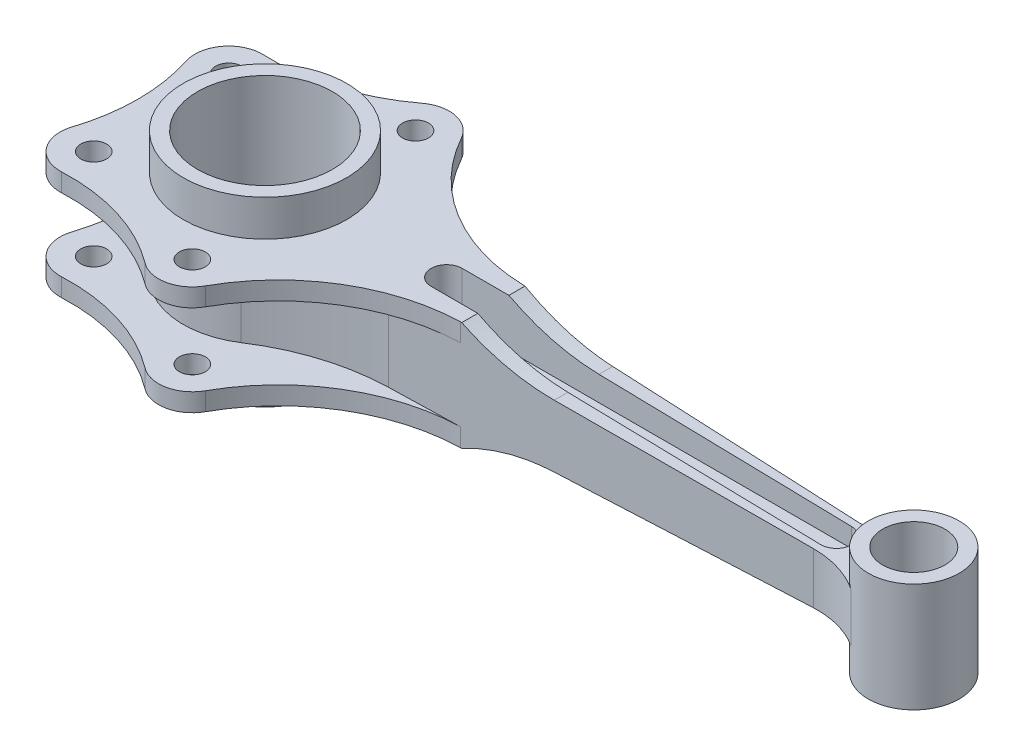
ISO-10303-21;
HEADER;
FILE_DESCRIPTION(('STEP AP214'),'2;1');
FILE_NAME('part.step','',(''),(''),'','','');
FILE_SCHEMA(('AUTOMOTIVE_DESIGN { 1 0 10303 214 1 1 1 1 }'));
ENDSEC;
DATA;
#1=APPLICATION_CONTEXT('core data for automotive mechanical design processes');
#2=APPLICATION_PROTOCOL_DEFINITION('international standard','automotive_design',2000,#1);
#3=PRODUCT_CONTEXT('',#1,'mechanical');
#4=PRODUCT('Part','Part','',(#3));
#5=PRODUCT_RELATED_PRODUCT_CATEGORY('part','',(#4));
#6=PRODUCT_DEFINITION_FORMATION('','',#4);
#7=PRODUCT_DEFINITION_CONTEXT('part definition',#1,'design');
#8=PRODUCT_DEFINITION('design','',#6,#7);
#9=PRODUCT_DEFINITION_SHAPE('','',#8);
#10=(LENGTH_UNIT() NAMED_UNIT(*) SI_UNIT(.MILLI.,.METRE.));
#11=(NAMED_UNIT(*) PLANE_ANGLE_UNIT() SI_UNIT($,.RADIAN.));
#12=(NAMED_UNIT(*) SI_UNIT($,.STERADIAN.) SOLID_ANGLE_UNIT());
#13=UNCERTAINTY_MEASURE_WITH_UNIT(LENGTH_MEASURE(1.E-05),#10,'distance_accuracy_value','');
#14=(GEOMETRIC_REPRESENTATION_CONTEXT(3) GLOBAL_UNCERTAINTY_ASSIGNED_CONTEXT((#13)) GLOBAL_UNIT_ASSIGNED_CONTEXT((#10,
#11,#12)) REPRESENTATION_CONTEXT('',''));
#15=CARTESIAN_POINT('',(0.,0.,0.));
#16=DIRECTION('',(0.,0.,1.));
#17=DIRECTION('',(1.,0.,0.));
#18=AXIS2_PLACEMENT_3D('',#15,#16,#17);
#19=CARTESIAN_POINT('',(220.,21.,-8.71991260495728));
#20=DIRECTION('',(-0.0261769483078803,0.,0.999657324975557));
#21=DIRECTION('',(0.999657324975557,0.,0.0261769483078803));
#22=AXIS2_PLACEMENT_3D('',#19,#20,#21);
#23=PLANE('',#22);
#24=CARTESIAN_POINT('',(124.408257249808,-89.9814381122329,-11.2230704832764));
#25=DIRECTION('',(-0.0261769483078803,0.,0.999657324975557));
#26=DIRECTION('',(0.999657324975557,0.,0.0261769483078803));
#27=AXIS2_PLACEMENT_3D('',#24,#25,#26);
#28=ELLIPSE('',#27,78.0267378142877,78.);
#29=CARTESIAN_POINT('',(88.,-21.,-12.1764542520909));
#30=VERTEX_POINT('',#29);
#31=CARTESIAN_POINT('',(122.706696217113,-12.,-11.2676274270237));
#32=VERTEX_POINT('',#31);
#33=EDGE_CURVE('E357',#30,#32,#28,.F.);
#34=ORIENTED_EDGE('',*,*,#33,.F.);
#35=DIRECTION('',(-0.999657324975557,0.,-0.0261769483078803));
#36=VECTOR('',#35,1.);
#37=CARTESIAN_POINT('',(220.,-21.,-8.71991260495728));
#38=LINE('',#37,#36);
#39=CARTESIAN_POINT('',(87.4820152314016,-21.,-12.1900181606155));
#40=VERTEX_POINT('',#39);
#41=EDGE_CURVE('E462',#30,#40,#38,.T.);
#42=ORIENTED_EDGE('',*,*,#41,.T.);
#43=DIRECTION('',(0.,-1.,0.));
#44=VECTOR('',#43,1.);
#45=CARTESIAN_POINT('',(87.4820152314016,-14.,-12.1900181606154));
#46=LINE('',#45,#44);
#47=CARTESIAN_POINT('',(87.4820152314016,-14.,-12.1900181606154));
#48=VERTEX_POINT('',#47);
#49=EDGE_CURVE('E439',#48,#40,#46,.T.);
#50=ORIENTED_EDGE('',*,*,#49,.F.);
#51=DIRECTION('',(0.999657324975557,0.,0.0261769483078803));
#52=VECTOR('',#51,1.);
#53=CARTESIAN_POINT('',(220.,-14.,-8.71991260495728));
#54=LINE('',#53,#52);
#55=CARTESIAN_POINT('',(60.4308716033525,-14.,-12.8983772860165));
#56=VERTEX_POINT('',#55);
#57=EDGE_CURVE('E456',#56,#48,#54,.T.);
#58=ORIENTED_EDGE('',*,*,#57,.F.);
#59=DIRECTION('',(0.,-1.,0.));
#60=VECTOR('',#59,1.);
#61=CARTESIAN_POINT('',(60.4308716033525,21.,-12.8983772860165));
#62=LINE('',#61,#60);
#63=CARTESIAN_POINT('',(60.4308716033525,14.,-12.8983772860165));
#64=VERTEX_POINT('',#63);
#65=EDGE_CURVE('E632',#64,#56,#62,.T.);
#66=ORIENTED_EDGE('',*,*,#65,.F.);
#67=DIRECTION('',(-0.999657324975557,0.,-0.0261769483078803));
#68=VECTOR('',#67,1.);
#69=CARTESIAN_POINT('',(220.,14.,-8.71991260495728));
#70=LINE('',#69,#68);
#71=CARTESIAN_POINT('',(87.4820152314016,14.,-12.1900181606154));
#72=VERTEX_POINT('',#71);
#73=EDGE_CURVE('E619',#72,#64,#70,.T.);
#74=ORIENTED_EDGE('',*,*,#73,.F.);
#75=DIRECTION('',(0.,1.,0.));
#76=VECTOR('',#75,1.);
#77=CARTESIAN_POINT('',(87.4820152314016,14.,-12.1900181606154));
#78=LINE('',#77,#76);
#79=CARTESIAN_POINT('',(87.4820152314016,21.,-12.1900181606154));
#80=VERTEX_POINT('',#79);
#81=EDGE_CURVE('E599',#72,#80,#78,.T.);
#82=ORIENTED_EDGE('',*,*,#81,.T.);
#83=DIRECTION('',(-0.999657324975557,0.,-0.0261769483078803));
#84=VECTOR('',#83,1.);
#85=CARTESIAN_POINT('',(220.,21.,-8.71991260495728));
#86=LINE('',#85,#84);
#87=CARTESIAN_POINT('',(88.,21.,-12.1764542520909));
#88=VERTEX_POINT('',#87);
#89=EDGE_CURVE('E621',#88,#80,#86,.T.);
#90=ORIENTED_EDGE('',*,*,#89,.F.);
#91=CARTESIAN_POINT('',(124.408257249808,89.9814381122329,-11.2230704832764));
#92=DIRECTION('',(-0.0261769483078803,0.,0.999657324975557));
#93=DIRECTION('',(0.999657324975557,0.,0.0261769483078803));
#94=AXIS2_PLACEMENT_3D('',#91,#92,#93);
#95=ELLIPSE('',#94,78.0267378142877,78.);
#96=CARTESIAN_POINT('',(122.706696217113,12.,-11.2676274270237));
#97=VERTEX_POINT('',#96);
#98=EDGE_CURVE('E515',#88,#97,#95,.T.);
#99=ORIENTED_EDGE('',*,*,#98,.T.);
#100=DIRECTION('',(0.999419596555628,-0.0218074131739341,0.0261707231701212));
#101=VECTOR('',#100,1.);
#102=CARTESIAN_POINT('',(219.757578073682,9.88234222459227,-8.72626064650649));
#103=LINE('',#102,#101);
#104=CARTESIAN_POINT('',(220.,9.87705255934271,-8.71991260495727));
#105=VERTEX_POINT('',#104);
#106=EDGE_CURVE('E507',#97,#105,#103,.T.);
#107=ORIENTED_EDGE('',*,*,#106,.T.);
#108=DIRECTION('',(0.,-1.,0.));
#109=VECTOR('',#108,1.);
#110=CARTESIAN_POINT('',(220.,21.,-8.71991260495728));
#111=LINE('',#110,#109);
#112=CARTESIAN_POINT('',(220.,-9.87705255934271,-8.71991260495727));
#113=VERTEX_POINT('',#112);
#114=EDGE_CURVE('E634',#105,#113,#111,.T.);
#115=ORIENTED_EDGE('',*,*,#114,.T.);
#116=DIRECTION('',(0.999419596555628,0.0218074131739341,0.0261707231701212));
#117=VECTOR('',#116,1.);
#118=CARTESIAN_POINT('',(220.672957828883,-9.86236856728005,-8.70229058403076));
#119=LINE('',#118,#117);
#120=EDGE_CURVE('E343',#32,#113,#119,.T.);
#121=ORIENTED_EDGE('',*,*,#120,.F.);
#122=EDGE_LOOP('',(#34,#42,#50,#58,#66,#74,#82,#90,#99,#107,#115,#121));
#123=FACE_BOUND('',#122,.T.);
#124=ADVANCED_FACE('F33',(#123),#23,.F.);
#125=CARTESIAN_POINT('',(220.,21.,8.71991260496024));
#126=DIRECTION('',(-0.0261769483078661,0.,-0.999657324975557));
#127=DIRECTION('',(-0.999657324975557,0.,0.0261769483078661));
#128=AXIS2_PLACEMENT_3D('',#125,#126,#127);
#129=PLANE('',#128);
#130=CARTESIAN_POINT('',(124.408257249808,-89.9814381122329,11.223070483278));
#131=DIRECTION('',(-0.0261769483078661,0.,-0.999657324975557));
#132=DIRECTION('',(-0.999657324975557,0.,0.0261769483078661));
#133=AXIS2_PLACEMENT_3D('',#130,#131,#132);
#134=ELLIPSE('',#133,78.0267378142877,78.);
#135=CARTESIAN_POINT('',(122.706696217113,-12.,11.2676274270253));
#136=VERTEX_POINT('',#135);
#137=CARTESIAN_POINT('',(88.,-21.,12.176454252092));
#138=VERTEX_POINT('',#137);
#139=EDGE_CURVE('E355',#136,#138,#134,.F.);
#140=ORIENTED_EDGE('',*,*,#139,.F.);
#141=DIRECTION('',(-0.999419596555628,-0.0218074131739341,0.0261707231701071));
#142=VECTOR('',#141,1.);
#143=CARTESIAN_POINT('',(220.672957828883,-9.86236856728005,8.70229058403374));
#144=LINE('',#143,#142);
#145=CARTESIAN_POINT('',(220.,-9.87705255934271,8.71991260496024));
#146=VERTEX_POINT('',#145);
#147=EDGE_CURVE('E347',#146,#136,#144,.T.);
#148=ORIENTED_EDGE('',*,*,#147,.F.);
#149=DIRECTION('',(0.,-1.,0.));
#150=VECTOR('',#149,1.);
#151=CARTESIAN_POINT('',(220.,21.,8.71991260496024));
#152=LINE('',#151,#150);
#153=CARTESIAN_POINT('',(220.,9.87705255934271,8.71991260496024));
#154=VERTEX_POINT('',#153);
#155=EDGE_CURVE('E327',#154,#146,#152,.T.);
#156=ORIENTED_EDGE('',*,*,#155,.F.);
#157=DIRECTION('',(-0.999419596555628,0.0218074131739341,0.0261707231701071));
#158=VECTOR('',#157,1.);
#159=CARTESIAN_POINT('',(219.757578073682,9.88234222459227,8.72626064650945));
#160=LINE('',#159,#158);
#161=CARTESIAN_POINT('',(122.706696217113,12.,11.2676274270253));
#162=VERTEX_POINT('',#161);
#163=EDGE_CURVE('E501',#154,#162,#160,.T.);
#164=ORIENTED_EDGE('',*,*,#163,.T.);
#165=CARTESIAN_POINT('',(124.408257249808,89.9814381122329,11.223070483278));
#166=DIRECTION('',(-0.0261769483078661,0.,-0.999657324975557));
#167=DIRECTION('',(-0.999657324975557,0.,0.0261769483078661));
#168=AXIS2_PLACEMENT_3D('',#165,#166,#167);
#169=ELLIPSE('',#168,78.0267378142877,78.);
#170=CARTESIAN_POINT('',(88.,21.,12.176454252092));
#171=VERTEX_POINT('',#170);
#172=EDGE_CURVE('E512',#162,#171,#169,.T.);
#173=ORIENTED_EDGE('',*,*,#172,.T.);
#174=DIRECTION('',(0.999657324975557,0.,-0.0261769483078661));
#175=VECTOR('',#174,1.);
#176=CARTESIAN_POINT('',(220.,21.,8.71991260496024));
#177=LINE('',#176,#175);
#178=CARTESIAN_POINT('',(87.4820152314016,21.,12.1900181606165));
#179=VERTEX_POINT('',#178);
#180=EDGE_CURVE('E623',#179,#171,#177,.T.);
#181=ORIENTED_EDGE('',*,*,#180,.F.);
#182=DIRECTION('',(0.,1.,0.));
#183=VECTOR('',#182,1.);
#184=CARTESIAN_POINT('',(87.4820152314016,14.,12.1900181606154));
#185=LINE('',#184,#183);
#186=CARTESIAN_POINT('',(87.4820152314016,14.,12.1900181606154));
#187=VERTEX_POINT('',#186);
#188=EDGE_CURVE('E602',#187,#179,#185,.T.);
#189=ORIENTED_EDGE('',*,*,#188,.F.);
#190=DIRECTION('',(0.999657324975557,0.,-0.0261769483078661));
#191=VECTOR('',#190,1.);
#192=CARTESIAN_POINT('',(220.,14.,8.71991260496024));
#193=LINE('',#192,#191);
#194=CARTESIAN_POINT('',(60.4308716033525,14.,12.8983772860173));
#195=VERTEX_POINT('',#194);
#196=EDGE_CURVE('E643',#195,#187,#193,.T.);
#197=ORIENTED_EDGE('',*,*,#196,.F.);
#198=DIRECTION('',(0.,-1.,0.));
#199=VECTOR('',#198,1.);
#200=CARTESIAN_POINT('',(60.4308716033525,21.,12.8983772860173));
#201=LINE('',#200,#199);
#202=CARTESIAN_POINT('',(60.4308716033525,-14.,12.8983772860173));
#203=VERTEX_POINT('',#202);
#204=EDGE_CURVE('E628',#195,#203,#201,.T.);
#205=ORIENTED_EDGE('',*,*,#204,.T.);
#206=DIRECTION('',(-0.999657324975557,0.,0.0261769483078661));
#207=VECTOR('',#206,1.);
#208=CARTESIAN_POINT('',(220.,-14.,8.71991260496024));
#209=LINE('',#208,#207);
#210=CARTESIAN_POINT('',(87.4820152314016,-14.,12.1900181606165));
#211=VERTEX_POINT('',#210);
#212=EDGE_CURVE('E675',#211,#203,#209,.T.);
#213=ORIENTED_EDGE('',*,*,#212,.F.);
#214=DIRECTION('',(0.,-1.,0.));
#215=VECTOR('',#214,1.);
#216=CARTESIAN_POINT('',(87.4820152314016,-14.,12.1900181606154));
#217=LINE('',#216,#215);
#218=CARTESIAN_POINT('',(87.4820152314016,-21.,12.1900181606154));
#219=VERTEX_POINT('',#218);
#220=EDGE_CURVE('E436',#211,#219,#217,.T.);
#221=ORIENTED_EDGE('',*,*,#220,.T.);
#222=DIRECTION('',(0.999657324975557,0.,-0.0261769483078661));
#223=VECTOR('',#222,1.);
#224=CARTESIAN_POINT('',(220.,-21.,8.71991260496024));
#225=LINE('',#224,#223);
#226=EDGE_CURVE('E459',#219,#138,#225,.T.);
#227=ORIENTED_EDGE('',*,*,#226,.T.);
#228=EDGE_LOOP('',(#140,#148,#156,#164,#173,#181,#189,#197,#205,#213,#221,#227));
#229=FACE_BOUND('',#228,.T.);
#230=ADVANCED_FACE('F756',(#229),#129,.F.);
#231=CARTESIAN_POINT('',(220.916193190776,21.,-43.7079189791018));
#232=DIRECTION('',(0.,-1.,0.));
#233=DIRECTION('',(0.,0.,-1.));
#234=AXIS2_PLACEMENT_3D('',#231,#232,#233);
#235=CYLINDRICAL_SURFACE('',#234,35.);
#236=CARTESIAN_POINT('',(220.916193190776,-9.8570611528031,-43.7079189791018));
#237=DIRECTION('',(0.0218148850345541,-0.999762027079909,0.));
#238=DIRECTION('',(-0.999762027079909,-0.0218148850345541,0.));
#239=AXIS2_PLACEMENT_3D('',#236,#237,#238);
#240=ELLIPSE('',#239,35.0083310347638,35.);
#241=CARTESIAN_POINT('',(240.305397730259,-9.43398720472,-14.5693063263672));
#242=VERTEX_POINT('',#241);
#243=EDGE_CURVE('E335',#113,#242,#240,.F.);
#244=ORIENTED_EDGE('',*,*,#243,.F.);
#245=ORIENTED_EDGE('',*,*,#114,.F.);
#246=CARTESIAN_POINT('',(220.916193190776,9.8570611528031,-43.7079189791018));
#247=DIRECTION('',(-0.0218148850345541,-0.999762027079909,0.));
#248=DIRECTION('',(0.999762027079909,-0.0218148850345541,0.));
#249=AXIS2_PLACEMENT_3D('',#246,#247,#248);
#250=ELLIPSE('',#249,35.0083310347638,35.);
#251=CARTESIAN_POINT('',(240.305397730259,9.43398720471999,-14.5693063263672));
#252=VERTEX_POINT('',#251);
#253=EDGE_CURVE('E504',#105,#252,#250,.F.);
#254=ORIENTED_EDGE('',*,*,#253,.T.);
#255=DIRECTION('',(0.,-1.,0.));
#256=VECTOR('',#255,1.);
#257=CARTESIAN_POINT('',(240.305397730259,21.,-14.5693063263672));
#258=LINE('',#257,#256);
#259=EDGE_CURVE('E328',#252,#242,#258,.T.);
#260=ORIENTED_EDGE('',*,*,#259,.T.);
#261=EDGE_LOOP('',(#244,#245,#254,#260));
#262=FACE_BOUND('',#261,.T.);
#263=ADVANCED_FACE('F750',(#262),#235,.F.);
#264=CARTESIAN_POINT('',(220.916193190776,21.,43.7079189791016));
#265=DIRECTION('',(0.,-1.,0.));
#266=DIRECTION('',(0.,0.,-1.));
#267=AXIS2_PLACEMENT_3D('',#264,#265,#266);
#268=CYLINDRICAL_SURFACE('',#267,34.9999999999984);
#269=CARTESIAN_POINT('',(220.916193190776,-9.85706115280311,43.7079189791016));
#270=DIRECTION('',(0.0218148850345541,-0.999762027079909,0.));
#271=DIRECTION('',(-0.999762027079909,-0.0218148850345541,0.));
#272=AXIS2_PLACEMENT_3D('',#269,#270,#271);
#273=ELLIPSE('',#272,35.0083310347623,34.9999999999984);
#274=CARTESIAN_POINT('',(240.305397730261,-9.43398720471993,14.5693063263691));
#275=VERTEX_POINT('',#274);
#276=EDGE_CURVE('E331',#275,#146,#273,.F.);
#277=ORIENTED_EDGE('',*,*,#276,.F.);
#278=DIRECTION('',(0.,-1.,0.));
#279=VECTOR('',#278,1.);
#280=CARTESIAN_POINT('',(240.305397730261,21.,14.5693063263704));
#281=LINE('',#280,#279);
#282=CARTESIAN_POINT('',(240.305397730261,9.43398720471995,14.5693063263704));
#283=VERTEX_POINT('',#282);
#284=EDGE_CURVE('E317',#283,#275,#281,.T.);
#285=ORIENTED_EDGE('',*,*,#284,.F.);
#286=CARTESIAN_POINT('',(220.916193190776,9.85706115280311,43.7079189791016));
#287=DIRECTION('',(-0.0218148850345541,-0.999762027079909,0.));
#288=DIRECTION('',(0.999762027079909,-0.0218148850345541,0.));
#289=AXIS2_PLACEMENT_3D('',#286,#287,#288);
#290=ELLIPSE('',#289,35.0083310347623,34.9999999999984);
#291=EDGE_CURVE('E499',#283,#154,#290,.F.);
#292=ORIENTED_EDGE('',*,*,#291,.T.);
#293=ORIENTED_EDGE('',*,*,#155,.T.);
#294=EDGE_LOOP('',(#277,#285,#292,#293));
#295=FACE_BOUND('',#294,.T.);
#296=ADVANCED_FACE('F332',(#295),#268,.F.);
#297=CARTESIAN_POINT('',(250.,21.,0.));
#298=DIRECTION('',(0.,-1.,0.));
#299=DIRECTION('',(0.,0.,-1.));
#300=AXIS2_PLACEMENT_3D('',#297,#298,#299);
#301=CYLINDRICAL_SURFACE('',#300,17.5);
#302=CARTESIAN_POINT('',(250.,-9.22245023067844,0.));
#303=DIRECTION('',(0.0218148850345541,-0.999762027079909,0.));
#304=DIRECTION('',(0.999762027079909,0.0218148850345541,0.));
#305=AXIS2_PLACEMENT_3D('',#302,#303,#304);
#306=ELLIPSE('',#305,17.5041655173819,17.4999999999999);
#307=EDGE_CURVE('E12',#275,#242,#306,.T.);
#308=ORIENTED_EDGE('',*,*,#307,.T.);
#309=ORIENTED_EDGE('',*,*,#259,.F.);
#310=CARTESIAN_POINT('',(250.,9.22245023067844,0.));
#311=DIRECTION('',(-0.0218148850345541,-0.999762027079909,0.));
#312=DIRECTION('',(0.999762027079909,-0.0218148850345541,0.));
#313=AXIS2_PLACEMENT_3D('',#310,#311,#312);
#314=ELLIPSE('',#313,17.5041655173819,17.4999999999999);
#315=EDGE_CURVE('E323',#252,#283,#314,.F.);
#316=ORIENTED_EDGE('',*,*,#315,.T.);
#317=ORIENTED_EDGE('',*,*,#284,.T.);
#318=EDGE_LOOP('',(#308,#309,#316,#317));
#319=FACE_BOUND('',#318,.T.);
#320=CARTESIAN_POINT('',(250.,-21.,0.));
#321=DIRECTION('',(0.,1.,0.));
#322=DIRECTION('',(0.,0.,1.));
#323=AXIS2_PLACEMENT_3D('',#320,#321,#322);
#324=CIRCLE('',#323,17.4999999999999);
#325=CARTESIAN_POINT('',(250.,-21.,17.4999999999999));
#326=VERTEX_POINT('',#325);
#327=EDGE_CURVE('E691',#326,#326,#324,.T.);
#328=ORIENTED_EDGE('',*,*,#327,.T.);
#329=EDGE_LOOP('',(#328));
#330=FACE_BOUND('',#329,.T.);
#331=CARTESIAN_POINT('',(250.,21.,0.));
#332=DIRECTION('',(0.,1.,0.));
#333=DIRECTION('',(0.,0.,1.));
#334=AXIS2_PLACEMENT_3D('',#331,#332,#333);
#335=CIRCLE('',#334,17.4999999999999);
#336=CARTESIAN_POINT('',(250.,21.,17.4999999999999));
#337=VERTEX_POINT('',#336);
#338=EDGE_CURVE('E485',#337,#337,#335,.T.);
#339=ORIENTED_EDGE('',*,*,#338,.F.);
#340=EDGE_LOOP('',(#339));
#341=FACE_BOUND('',#340,.T.);
#342=ADVANCED_FACE('F319',(#319,#330,#341),#301,.T.);
#343=CARTESIAN_POINT('',(220.916193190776,-21.,-43.7079189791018));
#344=DIRECTION('',(0.,-1.,0.));
#345=DIRECTION('',(0.,0.,1.));
#346=AXIS2_PLACEMENT_3D('',#343,#344,#345);
#347=PLANE('',#346);
#348=CARTESIAN_POINT('',(15.,-21.,43.));
#349=DIRECTION('',(0.,-1.,0.));
#350=DIRECTION('',(0.,0.,-1.));
#351=AXIS2_PLACEMENT_3D('',#348,#349,#350);
#352=CIRCLE('',#351,5.);
#353=CARTESIAN_POINT('',(15.,-21.,38.));
#354=VERTEX_POINT('',#353);
#355=EDGE_CURVE('E702',#354,#354,#352,.T.);
#356=ORIENTED_EDGE('',*,*,#355,.F.);
#357=EDGE_LOOP('',(#356));
#358=FACE_BOUND('',#357,.T.);
#359=CARTESIAN_POINT('',(-40.,-21.,26.));
#360=DIRECTION('',(0.,-1.,0.));
#361=DIRECTION('',(0.,0.,-1.));
#362=AXIS2_PLACEMENT_3D('',#359,#360,#361);
#363=CIRCLE('',#362,5.);
#364=CARTESIAN_POINT('',(-40.,-21.,21.));
#365=VERTEX_POINT('',#364);
#366=EDGE_CURVE('E699',#365,#365,#363,.T.);
#367=ORIENTED_EDGE('',*,*,#366,.F.);
#368=EDGE_LOOP('',(#367));
#369=FACE_BOUND('',#368,.T.);
#370=CARTESIAN_POINT('',(-40.,-21.,-26.));
#371=DIRECTION('',(0.,-1.,0.));
#372=DIRECTION('',(0.,0.,-1.));
#373=AXIS2_PLACEMENT_3D('',#370,#371,#372);
#374=CIRCLE('',#373,5.);
#375=CARTESIAN_POINT('',(-40.,-21.,-31.));
#376=VERTEX_POINT('',#375);
#377=EDGE_CURVE('E696',#376,#376,#374,.T.);
#378=ORIENTED_EDGE('',*,*,#377,.F.);
#379=EDGE_LOOP('',(#378));
#380=FACE_BOUND('',#379,.T.);
#381=CARTESIAN_POINT('',(15.,-21.,-43.));
#382=DIRECTION('',(0.,-1.,0.));
#383=DIRECTION('',(0.,0.,-1.));
#384=AXIS2_PLACEMENT_3D('',#381,#382,#383);
#385=CIRCLE('',#384,5.);
#386=CARTESIAN_POINT('',(15.,-21.,-48.));
#387=VERTEX_POINT('',#386);
#388=EDGE_CURVE('E692',#387,#387,#385,.T.);
#389=ORIENTED_EDGE('',*,*,#388,.F.);
#390=EDGE_LOOP('',(#389));
#391=FACE_BOUND('',#390,.T.);
#392=CARTESIAN_POINT('',(0.,-21.,0.));
#393=DIRECTION('',(0.,-1.,0.));
#394=DIRECTION('',(0.,0.,-1.));
#395=AXIS2_PLACEMENT_3D('',#392,#393,#394);
#396=CIRCLE('',#395,31.5);
#397=CARTESIAN_POINT('',(0.,-21.,-31.5));
#398=VERTEX_POINT('',#397);
#399=EDGE_CURVE('E659',#398,#398,#396,.T.);
#400=ORIENTED_EDGE('',*,*,#399,.F.);
#401=EDGE_LOOP('',(#400));
#402=FACE_BOUND('',#401,.T.);
#403=ORIENTED_EDGE('',*,*,#41,.F.);
#404=DIRECTION('',(0.,0.,1.));
#405=VECTOR('',#404,1.);
#406=CARTESIAN_POINT('',(88.,-21.,-56.));
#407=LINE('',#406,#405);
#408=CARTESIAN_POINT('',(88.,-21.,-6.00000000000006));
#409=VERTEX_POINT('',#408);
#410=EDGE_CURVE('E726',#30,#409,#407,.T.);
#411=ORIENTED_EDGE('',*,*,#410,.T.);
#412=DIRECTION('',(1.,0.,0.));
#413=VECTOR('',#412,1.);
#414=CARTESIAN_POINT('',(220.916193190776,-21.,-6.0000000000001));
#415=LINE('',#414,#413);
#416=CARTESIAN_POINT('',(70.,-21.,-6.00000000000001));
#417=VERTEX_POINT('',#416);
#418=EDGE_CURVE('E680',#417,#409,#415,.T.);
#419=ORIENTED_EDGE('',*,*,#418,.F.);
#420=CARTESIAN_POINT('',(70.,-21.,0.));
#421=DIRECTION('',(0.,-1.,0.));
#422=DIRECTION('',(0.,0.,-1.));
#423=AXIS2_PLACEMENT_3D('',#420,#421,#422);
#424=CIRCLE('',#423,6.);
#425=CARTESIAN_POINT('',(70.,-21.,6.));
#426=VERTEX_POINT('',#425);
#427=EDGE_CURVE('E683',#426,#417,#424,.T.);
#428=ORIENTED_EDGE('',*,*,#427,.F.);
#429=DIRECTION('',(-1.,0.,0.));
#430=VECTOR('',#429,1.);
#431=CARTESIAN_POINT('',(220.916193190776,-21.,6.));
#432=LINE('',#431,#430);
#433=CARTESIAN_POINT('',(88.,-21.,6.));
#434=VERTEX_POINT('',#433);
#435=EDGE_CURVE('E678',#434,#426,#432,.T.);
#436=ORIENTED_EDGE('',*,*,#435,.F.);
#437=EDGE_CURVE('E723',#434,#138,#407,.T.);
#438=ORIENTED_EDGE('',*,*,#437,.T.);
#439=ORIENTED_EDGE('',*,*,#226,.F.);
#440=CARTESIAN_POINT('',(89.366755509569,-21.,84.1653455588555));
#441=DIRECTION('',(0.,-1.,0.));
#442=DIRECTION('',(0.,0.,-1.));
#443=AXIS2_PLACEMENT_3D('',#440,#441,#442);
#444=CIRCLE('',#443,72.);
#445=CARTESIAN_POINT('',(26.3737390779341,-21.,49.2958763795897));
#446=VERTEX_POINT('',#445);
#447=EDGE_CURVE('E410',#446,#219,#444,.T.);
#448=ORIENTED_EDGE('',*,*,#447,.F.);
#449=CARTESIAN_POINT('',(15.,-21.,43.));
#450=DIRECTION('',(0.,1.,0.));
#451=DIRECTION('',(0.,0.,-1.));
#452=AXIS2_PLACEMENT_3D('',#449,#450,#451);
#453=CIRCLE('',#452,13.);
#454=CARTESIAN_POINT('',(7.18194667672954,-21.,53.3864354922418));
#455=VERTEX_POINT('',#454);
#456=EDGE_CURVE('E413',#455,#446,#453,.T.);
#457=ORIENTED_EDGE('',*,*,#456,.F.);
#458=CARTESIAN_POINT('',(-36.1180409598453,-21.,110.911308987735));
#459=DIRECTION('',(0.,-1.,0.));
#460=DIRECTION('',(0.,0.,-1.));
#461=AXIS2_PLACEMENT_3D('',#458,#459,#460);
#462=CIRCLE('',#461,72.);
#463=CARTESIAN_POINT('',(-39.4062886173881,-21.,38.9864354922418));
#464=VERTEX_POINT('',#463);
#465=EDGE_CURVE('E415',#464,#455,#462,.T.);
#466=ORIENTED_EDGE('',*,*,#465,.F.);
#467=CARTESIAN_POINT('',(-40.,-21.,26.));
#468=DIRECTION('',(0.,1.,0.));
#469=DIRECTION('',(0.,0.,-1.));
#470=AXIS2_PLACEMENT_3D('',#467,#468,#469);
#471=CIRCLE('',#470,13.);
#472=CARTESIAN_POINT('',(-52.3769011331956,-21.,22.0235294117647));
#473=VERTEX_POINT('',#472);
#474=EDGE_CURVE('E417',#473,#464,#471,.T.);
#475=ORIENTED_EDGE('',*,*,#474,.F.);
#476=CARTESIAN_POINT('',(-120.925892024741,-21.,0.));
#477=DIRECTION('',(0.,-1.,0.));
#478=DIRECTION('',(0.,0.,-1.));
#479=AXIS2_PLACEMENT_3D('',#476,#477,#478);
#480=CIRCLE('',#479,72.);
#481=CARTESIAN_POINT('',(-52.3769011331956,-21.,-22.0235294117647));
#482=VERTEX_POINT('',#481);
#483=EDGE_CURVE('E384',#482,#473,#480,.T.);
#484=ORIENTED_EDGE('',*,*,#483,.F.);
#485=CARTESIAN_POINT('',(-40.,-21.,-26.));
#486=DIRECTION('',(0.,1.,0.));
#487=DIRECTION('',(0.,0.,1.));
#488=AXIS2_PLACEMENT_3D('',#485,#486,#487);
#489=CIRCLE('',#488,13.);
#490=CARTESIAN_POINT('',(-39.4062886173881,-21.,-38.9864354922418));
#491=VERTEX_POINT('',#490);
#492=EDGE_CURVE('E379',#491,#482,#489,.T.);
#493=ORIENTED_EDGE('',*,*,#492,.F.);
#494=CARTESIAN_POINT('',(-36.1180409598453,-21.,-110.911308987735));
#495=DIRECTION('',(0.,-1.,0.));
#496=DIRECTION('',(0.,0.,1.));
#497=AXIS2_PLACEMENT_3D('',#494,#495,#496);
#498=CIRCLE('',#497,72.);
#499=CARTESIAN_POINT('',(7.18194667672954,-21.,-53.3864354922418));
#500=VERTEX_POINT('',#499);
#501=EDGE_CURVE('E404',#500,#491,#498,.T.);
#502=ORIENTED_EDGE('',*,*,#501,.F.);
#503=CARTESIAN_POINT('',(15.,-21.,-43.));
#504=DIRECTION('',(0.,1.,0.));
#505=DIRECTION('',(0.,0.,1.));
#506=AXIS2_PLACEMENT_3D('',#503,#504,#505);
#507=CIRCLE('',#506,13.);
#508=CARTESIAN_POINT('',(26.3737390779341,-21.,-49.2958763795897));
#509=VERTEX_POINT('',#508);
#510=EDGE_CURVE('E406',#509,#500,#507,.T.);
#511=ORIENTED_EDGE('',*,*,#510,.F.);
#512=CARTESIAN_POINT('',(89.366755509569,-21.,-84.1653455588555));
#513=DIRECTION('',(0.,-1.,0.));
#514=DIRECTION('',(0.,0.,1.));
#515=AXIS2_PLACEMENT_3D('',#512,#513,#514);
#516=CIRCLE('',#515,72.);
#517=EDGE_CURVE('E408',#40,#509,#516,.T.);
#518=ORIENTED_EDGE('',*,*,#517,.F.);
#519=EDGE_LOOP('',(#403,#411,#419,#428,#436,#438,#439,#448,#457,#466,#475,#484,#493,#502,#511,#518));
#520=FACE_BOUND('',#519,.T.);
#521=ADVANCED_FACE('F746',(#358,#369,#380,#391,#402,#520),#347,.T.);
#522=CARTESIAN_POINT('',(70.,-35.,-6.00000000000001));
#523=DIRECTION('',(0.,0.,-1.));
#524=DIRECTION('',(-1.,0.,0.));
#525=AXIS2_PLACEMENT_3D('',#522,#523,#524);
#526=PLANE('',#525);
#527=CARTESIAN_POINT('',(124.408257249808,-89.9814381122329,-6.00000000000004));
#528=DIRECTION('',(0.,0.,-1.));
#529=DIRECTION('',(-1.,0.,0.));
#530=AXIS2_PLACEMENT_3D('',#527,#528,#529);
#531=CIRCLE('',#530,78.);
#532=CARTESIAN_POINT('',(122.706696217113,-12.,-6.00000000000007));
#533=VERTEX_POINT('',#532);
#534=EDGE_CURVE('E353',#533,#409,#531,.F.);
#535=ORIENTED_EDGE('',*,*,#534,.F.);
#536=DIRECTION('',(-0.999762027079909,-0.0218148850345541,0.));
#537=VECTOR('',#536,1.);
#538=CARTESIAN_POINT('',(69.5234595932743,-13.1604623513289,-6.00000000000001));
#539=LINE('',#538,#537);
#540=CARTESIAN_POINT('',(220.,-9.87705255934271,-6.0000000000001));
#541=VERTEX_POINT('',#540);
#542=EDGE_CURVE('E336',#541,#533,#539,.T.);
#543=ORIENTED_EDGE('',*,*,#542,.F.);
#544=DIRECTION('',(0.,1.,0.));
#545=VECTOR('',#544,1.);
#546=CARTESIAN_POINT('',(220.,-35.,-6.0000000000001));
#547=LINE('',#546,#545);
#548=CARTESIAN_POINT('',(220.,-2.5,-6.0000000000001));
#549=VERTEX_POINT('',#548);
#550=EDGE_CURVE('E375',#541,#549,#547,.T.);
#551=ORIENTED_EDGE('',*,*,#550,.T.);
#552=DIRECTION('',(-1.,0.,0.));
#553=VECTOR('',#552,1.);
#554=CARTESIAN_POINT('',(70.,-2.5,-6.00000000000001));
#555=LINE('',#554,#553);
#556=CARTESIAN_POINT('',(70.,-2.5,-6.00000000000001));
#557=VERTEX_POINT('',#556);
#558=EDGE_CURVE('E362',#549,#557,#555,.T.);
#559=ORIENTED_EDGE('',*,*,#558,.T.);
#560=DIRECTION('',(0.,1.,0.));
#561=VECTOR('',#560,1.);
#562=CARTESIAN_POINT('',(70.,-35.,-6.00000000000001));
#563=LINE('',#562,#561);
#564=EDGE_CURVE('E377',#417,#557,#563,.T.);
#565=ORIENTED_EDGE('',*,*,#564,.F.);
#566=ORIENTED_EDGE('',*,*,#418,.T.);
#567=EDGE_LOOP('',(#535,#543,#551,#559,#565,#566));
#568=FACE_BOUND('',#567,.T.);
#569=ADVANCED_FACE('F740',(#568),#526,.F.);
#570=CARTESIAN_POINT('',(220.,-35.,0.));
#571=DIRECTION('',(0.,1.,0.));
#572=DIRECTION('',(0.,0.,1.));
#573=AXIS2_PLACEMENT_3D('',#570,#571,#572);
#574=CYLINDRICAL_SURFACE('',#573,6.00000000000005);
#575=CARTESIAN_POINT('',(220.,-9.87705255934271,0.));
#576=DIRECTION('',(0.0218148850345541,-0.999762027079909,0.));
#577=DIRECTION('',(0.999762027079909,0.0218148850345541,0.));
#578=AXIS2_PLACEMENT_3D('',#575,#576,#577);
#579=ELLIPSE('',#578,6.00142817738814,6.00000000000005);
#580=CARTESIAN_POINT('',(220.,-9.87705255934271,6.));
#581=VERTEX_POINT('',#580);
#582=EDGE_CURVE('E729',#581,#541,#579,.F.);
#583=ORIENTED_EDGE('',*,*,#582,.F.);
#584=DIRECTION('',(0.,1.,0.));
#585=VECTOR('',#584,1.);
#586=CARTESIAN_POINT('',(220.,-35.,6.));
#587=LINE('',#586,#585);
#588=CARTESIAN_POINT('',(220.,-2.5,6.));
#589=VERTEX_POINT('',#588);
#590=EDGE_CURVE('E373',#581,#589,#587,.T.);
#591=ORIENTED_EDGE('',*,*,#590,.T.);
#592=CARTESIAN_POINT('',(220.,-2.5,0.));
#593=DIRECTION('',(0.,1.,0.));
#594=DIRECTION('',(0.,0.,-1.));
#595=AXIS2_PLACEMENT_3D('',#592,#593,#594);
#596=CIRCLE('',#595,6.00000000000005);
#597=EDGE_CURVE('E365',#589,#549,#596,.T.);
#598=ORIENTED_EDGE('',*,*,#597,.T.);
#599=ORIENTED_EDGE('',*,*,#550,.F.);
#600=EDGE_LOOP('',(#583,#591,#598,#599));
#601=FACE_BOUND('',#600,.T.);
#602=ADVANCED_FACE('F765',(#601),#574,.F.);
#603=CARTESIAN_POINT('',(70.,-35.,6.));
#604=DIRECTION('',(0.,0.,1.));
#605=DIRECTION('',(1.,0.,0.));
#606=AXIS2_PLACEMENT_3D('',#603,#604,#605);
#607=PLANE('',#606);
#608=CARTESIAN_POINT('',(124.408257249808,-89.9814381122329,6.));
#609=DIRECTION('',(0.,0.,1.));
#610=DIRECTION('',(1.,0.,0.));
#611=AXIS2_PLACEMENT_3D('',#608,#609,#610);
#612=CIRCLE('',#611,78.);
#613=CARTESIAN_POINT('',(122.706696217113,-12.,6.));
#614=VERTEX_POINT('',#613);
#615=EDGE_CURVE('E42',#434,#614,#612,.F.);
#616=ORIENTED_EDGE('',*,*,#615,.F.);
#617=ORIENTED_EDGE('',*,*,#435,.T.);
#618=DIRECTION('',(0.,1.,0.));
#619=VECTOR('',#618,1.);
#620=CARTESIAN_POINT('',(70.,-35.,6.));
#621=LINE('',#620,#619);
#622=CARTESIAN_POINT('',(70.,-2.5,6.));
#623=VERTEX_POINT('',#622);
#624=EDGE_CURVE('E371',#426,#623,#621,.T.);
#625=ORIENTED_EDGE('',*,*,#624,.T.);
#626=DIRECTION('',(1.,0.,0.));
#627=VECTOR('',#626,1.);
#628=CARTESIAN_POINT('',(70.,-2.5,6.));
#629=LINE('',#628,#627);
#630=EDGE_CURVE('E368',#623,#589,#629,.T.);
#631=ORIENTED_EDGE('',*,*,#630,.T.);
#632=ORIENTED_EDGE('',*,*,#590,.F.);
#633=DIRECTION('',(0.999762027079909,0.0218148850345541,0.));
#634=VECTOR('',#633,1.);
#635=CARTESIAN_POINT('',(69.5234595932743,-13.1604623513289,6.));
#636=LINE('',#635,#634);
#637=EDGE_CURVE('E685',#614,#581,#636,.T.);
#638=ORIENTED_EDGE('',*,*,#637,.F.);
#639=EDGE_LOOP('',(#616,#617,#625,#631,#632,#638));
#640=FACE_BOUND('',#639,.T.);
#641=ADVANCED_FACE('F763',(#640),#607,.F.);
#642=CARTESIAN_POINT('',(0.,35.,0.));
#643=DIRECTION('',(0.,-1.,0.));
#644=DIRECTION('',(0.,0.,-1.));
#645=AXIS2_PLACEMENT_3D('',#642,#643,#644);
#646=CYLINDRICAL_SURFACE('',#645,31.5);
#647=CARTESIAN_POINT('',(0.,-14.,0.));
#648=DIRECTION('',(0.,-1.,0.));
#649=DIRECTION('',(0.,0.,-1.));
#650=AXIS2_PLACEMENT_3D('',#647,#648,#649);
#651=CIRCLE('',#650,31.5);
#652=CARTESIAN_POINT('',(17.2228129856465,-14.,26.3746983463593));
#653=VERTEX_POINT('',#652);
#654=CARTESIAN_POINT('',(17.2228129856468,-14.,-26.3746983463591));
#655=VERTEX_POINT('',#654);
#656=EDGE_CURVE('E452',#653,#655,#651,.T.);
#657=ORIENTED_EDGE('',*,*,#656,.F.);
#658=DIRECTION('',(0.,-1.,0.));
#659=VECTOR('',#658,1.);
#660=CARTESIAN_POINT('',(17.2228129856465,21.,26.3746983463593));
#661=LINE('',#660,#659);
#662=CARTESIAN_POINT('',(17.2228129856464,14.,26.3746983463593));
#663=VERTEX_POINT('',#662);
#664=EDGE_CURVE('E631',#663,#653,#661,.T.);
#665=ORIENTED_EDGE('',*,*,#664,.F.);
#666=CARTESIAN_POINT('',(0.,14.,0.));
#667=DIRECTION('',(0.,1.,0.));
#668=DIRECTION('',(0.,0.,1.));
#669=AXIS2_PLACEMENT_3D('',#666,#667,#668);
#670=CIRCLE('',#669,31.5);
#671=CARTESIAN_POINT('',(17.2228129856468,14.,-26.3746983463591));
#672=VERTEX_POINT('',#671);
#673=EDGE_CURVE('E615',#672,#663,#670,.T.);
#674=ORIENTED_EDGE('',*,*,#673,.F.);
#675=DIRECTION('',(0.,-1.,0.));
#676=VECTOR('',#675,1.);
#677=CARTESIAN_POINT('',(17.2228129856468,21.,-26.3746983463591));
#678=LINE('',#677,#676);
#679=EDGE_CURVE('E635',#672,#655,#678,.T.);
#680=ORIENTED_EDGE('',*,*,#679,.T.);
#681=EDGE_LOOP('',(#657,#665,#674,#680));
#682=FACE_BOUND('',#681,.T.);
#683=ADVANCED_FACE('F822',(#682),#646,.T.);
#684=CARTESIAN_POINT('',(62.6035583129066,21.,-95.8699352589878));
#685=DIRECTION('',(0.,-1.,0.));
#686=DIRECTION('',(0.,0.,-1.));
#687=AXIS2_PLACEMENT_3D('',#684,#685,#686);
#688=CYLINDRICAL_SURFACE('',#687,83.);
#689=CARTESIAN_POINT('',(62.6035583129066,-14.,-95.8699352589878));
#690=DIRECTION('',(0.,-1.,0.));
#691=DIRECTION('',(0.,0.,-1.));
#692=AXIS2_PLACEMENT_3D('',#689,#690,#691);
#693=CIRCLE('',#692,83.);
#694=EDGE_CURVE('E58',#655,#56,#693,.F.);
#695=ORIENTED_EDGE('',*,*,#694,.F.);
#696=ORIENTED_EDGE('',*,*,#679,.F.);
#697=CARTESIAN_POINT('',(62.6035583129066,14.,-95.8699352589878));
#698=DIRECTION('',(0.,1.,0.));
#699=DIRECTION('',(0.,0.,1.));
#700=AXIS2_PLACEMENT_3D('',#697,#698,#699);
#701=CIRCLE('',#700,83.);
#702=EDGE_CURVE('E617',#64,#672,#701,.F.);
#703=ORIENTED_EDGE('',*,*,#702,.F.);
#704=ORIENTED_EDGE('',*,*,#65,.T.);
#705=EDGE_LOOP('',(#695,#696,#703,#704));
#706=FACE_BOUND('',#705,.T.);
#707=ADVANCED_FACE('F871',(#706),#688,.F.);
#708=CARTESIAN_POINT('',(62.6035583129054,21.,95.8699352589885));
#709=DIRECTION('',(0.,-1.,0.));
#710=DIRECTION('',(0.,0.,-1.));
#711=AXIS2_PLACEMENT_3D('',#708,#709,#710);
#712=CYLINDRICAL_SURFACE('',#711,83.);
#713=CARTESIAN_POINT('',(62.6035583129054,-14.,95.8699352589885));
#714=DIRECTION('',(0.,-1.,0.));
#715=DIRECTION('',(0.,0.,-1.));
#716=AXIS2_PLACEMENT_3D('',#713,#714,#715);
#717=CIRCLE('',#716,83.);
#718=EDGE_CURVE('E423',#203,#653,#717,.F.);
#719=ORIENTED_EDGE('',*,*,#718,.F.);
#720=ORIENTED_EDGE('',*,*,#204,.F.);
#721=CARTESIAN_POINT('',(62.6035583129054,14.,95.8699352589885));
#722=DIRECTION('',(0.,1.,0.));
#723=DIRECTION('',(0.,0.,1.));
#724=AXIS2_PLACEMENT_3D('',#721,#722,#723);
#725=CIRCLE('',#724,83.);
#726=EDGE_CURVE('E594',#663,#195,#725,.F.);
#727=ORIENTED_EDGE('',*,*,#726,.F.);
#728=ORIENTED_EDGE('',*,*,#664,.T.);
#729=EDGE_LOOP('',(#719,#720,#727,#728));
#730=FACE_BOUND('',#729,.T.);
#731=ADVANCED_FACE('F826',(#730),#712,.F.);
#732=CARTESIAN_POINT('',(122.706696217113,12.,-56.));
#733=DIRECTION('',(-0.0218148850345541,-0.999762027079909,0.));
#734=DIRECTION('',(0.999762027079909,-0.0218148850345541,0.));
#735=AXIS2_PLACEMENT_3D('',#732,#733,#734);
#736=PLANE('',#735);
#737=ORIENTED_EDGE('',*,*,#315,.F.);
#738=ORIENTED_EDGE('',*,*,#253,.F.);
#739=ORIENTED_EDGE('',*,*,#106,.F.);
#740=DIRECTION('',(0.,0.,1.));
#741=VECTOR('',#740,1.);
#742=CARTESIAN_POINT('',(122.706696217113,12.,-56.));
#743=LINE('',#742,#741);
#744=CARTESIAN_POINT('',(122.706696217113,12.,-6.00000000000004));
#745=VERTEX_POINT('',#744);
#746=EDGE_CURVE('E492',#97,#745,#743,.T.);
#747=ORIENTED_EDGE('',*,*,#746,.T.);
#748=DIRECTION('',(0.999762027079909,-0.0218148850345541,0.));
#749=VECTOR('',#748,1.);
#750=CARTESIAN_POINT('',(69.5234595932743,13.1604623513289,-6.00000000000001));
#751=LINE('',#750,#749);
#752=CARTESIAN_POINT('',(220.,9.87705255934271,-6.0000000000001));
#753=VERTEX_POINT('',#752);
#754=EDGE_CURVE('E653',#745,#753,#751,.T.);
#755=ORIENTED_EDGE('',*,*,#754,.T.);
#756=CARTESIAN_POINT('',(220.,9.87705255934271,0.));
#757=DIRECTION('',(-0.0218148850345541,-0.999762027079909,0.));
#758=DIRECTION('',(0.999762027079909,-0.0218148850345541,0.));
#759=AXIS2_PLACEMENT_3D('',#756,#757,#758);
#760=ELLIPSE('',#759,6.00142817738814,6.00000000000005);
#761=CARTESIAN_POINT('',(220.,9.87705255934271,6.));
#762=VERTEX_POINT('',#761);
#763=EDGE_CURVE('E495',#753,#762,#760,.T.);
#764=ORIENTED_EDGE('',*,*,#763,.T.);
#765=DIRECTION('',(-0.999762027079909,0.0218148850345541,0.));
#766=VECTOR('',#765,1.);
#767=CARTESIAN_POINT('',(69.5234595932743,13.1604623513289,6.));
#768=LINE('',#767,#766);
#769=CARTESIAN_POINT('',(122.706696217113,12.,6.));
#770=VERTEX_POINT('',#769);
#771=EDGE_CURVE('E497',#762,#770,#768,.T.);
#772=ORIENTED_EDGE('',*,*,#771,.T.);
#773=EDGE_CURVE('E488',#770,#162,#743,.T.);
#774=ORIENTED_EDGE('',*,*,#773,.T.);
#775=ORIENTED_EDGE('',*,*,#163,.F.);
#776=ORIENTED_EDGE('',*,*,#291,.F.);
#777=EDGE_LOOP('',(#737,#738,#739,#747,#755,#764,#772,#774,#775,#776));
#778=FACE_BOUND('',#777,.T.);
#779=ADVANCED_FACE('F752',(#778),#736,.F.);
#780=CARTESIAN_POINT('',(220.916193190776,21.,-43.7079189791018));
#781=DIRECTION('',(0.,1.,0.));
#782=DIRECTION('',(0.,0.,1.));
#783=AXIS2_PLACEMENT_3D('',#780,#781,#782);
#784=PLANE('',#783);
#785=CARTESIAN_POINT('',(15.,21.,43.));
#786=DIRECTION('',(0.,1.,0.));
#787=DIRECTION('',(0.,0.,1.));
#788=AXIS2_PLACEMENT_3D('',#785,#786,#787);
#789=CIRCLE('',#788,5.);
#790=CARTESIAN_POINT('',(15.,21.,48.));
#791=VERTEX_POINT('',#790);
#792=EDGE_CURVE('E467',#791,#791,#789,.T.);
#793=ORIENTED_EDGE('',*,*,#792,.F.);
#794=EDGE_LOOP('',(#793));
#795=FACE_BOUND('',#794,.T.);
#796=CARTESIAN_POINT('',(-40.,21.,26.));
#797=DIRECTION('',(0.,1.,0.));
#798=DIRECTION('',(0.,0.,1.));
#799=AXIS2_PLACEMENT_3D('',#796,#797,#798);
#800=CIRCLE('',#799,5.);
#801=CARTESIAN_POINT('',(-40.,21.,31.));
#802=VERTEX_POINT('',#801);
#803=EDGE_CURVE('E471',#802,#802,#800,.T.);
#804=ORIENTED_EDGE('',*,*,#803,.F.);
#805=EDGE_LOOP('',(#804));
#806=FACE_BOUND('',#805,.T.);
#807=CARTESIAN_POINT('',(-40.,21.,-26.));
#808=DIRECTION('',(0.,1.,0.));
#809=DIRECTION('',(0.,0.,1.));
#810=AXIS2_PLACEMENT_3D('',#807,#808,#809);
#811=CIRCLE('',#810,5.);
#812=CARTESIAN_POINT('',(-40.,21.,-21.));
#813=VERTEX_POINT('',#812);
#814=EDGE_CURVE('E475',#813,#813,#811,.T.);
#815=ORIENTED_EDGE('',*,*,#814,.F.);
#816=EDGE_LOOP('',(#815));
#817=FACE_BOUND('',#816,.T.);
#818=CARTESIAN_POINT('',(15.,21.,-43.));
#819=DIRECTION('',(0.,1.,0.));
#820=DIRECTION('',(0.,0.,1.));
#821=AXIS2_PLACEMENT_3D('',#818,#819,#820);
#822=CIRCLE('',#821,5.);
#823=CARTESIAN_POINT('',(15.,21.,-38.));
#824=VERTEX_POINT('',#823);
#825=EDGE_CURVE('E479',#824,#824,#822,.T.);
#826=ORIENTED_EDGE('',*,*,#825,.F.);
#827=EDGE_LOOP('',(#826));
#828=FACE_BOUND('',#827,.T.);
#829=DIRECTION('',(0.,0.,1.));
#830=VECTOR('',#829,1.);
#831=CARTESIAN_POINT('',(88.,21.,-56.));
#832=LINE('',#831,#830);
#833=CARTESIAN_POINT('',(88.,21.,-6.00000000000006));
#834=VERTEX_POINT('',#833);
#835=EDGE_CURVE('E491',#88,#834,#832,.T.);
#836=ORIENTED_EDGE('',*,*,#835,.F.);
#837=ORIENTED_EDGE('',*,*,#89,.T.);
#838=CARTESIAN_POINT('',(89.366755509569,21.,-84.1653455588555));
#839=DIRECTION('',(0.,-1.,0.));
#840=DIRECTION('',(0.,0.,1.));
#841=AXIS2_PLACEMENT_3D('',#838,#839,#840);
#842=CIRCLE('',#841,72.);
#843=CARTESIAN_POINT('',(26.3737390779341,21.,-49.2958763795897));
#844=VERTEX_POINT('',#843);
#845=EDGE_CURVE('E584',#80,#844,#842,.T.);
#846=ORIENTED_EDGE('',*,*,#845,.T.);
#847=CARTESIAN_POINT('',(15.,21.,-43.));
#848=DIRECTION('',(0.,1.,0.));
#849=DIRECTION('',(0.,0.,1.));
#850=AXIS2_PLACEMENT_3D('',#847,#848,#849);
#851=CIRCLE('',#850,13.);
#852=CARTESIAN_POINT('',(7.18194667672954,21.,-53.3864354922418));
#853=VERTEX_POINT('',#852);
#854=EDGE_CURVE('E587',#844,#853,#851,.T.);
#855=ORIENTED_EDGE('',*,*,#854,.T.);
#856=CARTESIAN_POINT('',(-36.1180409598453,21.,-110.911308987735));
#857=DIRECTION('',(0.,-1.,0.));
#858=DIRECTION('',(0.,0.,1.));
#859=AXIS2_PLACEMENT_3D('',#856,#857,#858);
#860=CIRCLE('',#859,72.);
#861=CARTESIAN_POINT('',(-39.4062886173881,21.,-38.9864354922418));
#862=VERTEX_POINT('',#861);
#863=EDGE_CURVE('E543',#853,#862,#860,.T.);
#864=ORIENTED_EDGE('',*,*,#863,.T.);
#865=CARTESIAN_POINT('',(-40.,21.,-26.));
#866=DIRECTION('',(0.,1.,0.));
#867=DIRECTION('',(0.,0.,1.));
#868=AXIS2_PLACEMENT_3D('',#865,#866,#867);
#869=CIRCLE('',#868,13.);
#870=CARTESIAN_POINT('',(-52.3769011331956,21.,-22.0235294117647));
#871=VERTEX_POINT('',#870);
#872=EDGE_CURVE('E538',#862,#871,#869,.T.);
#873=ORIENTED_EDGE('',*,*,#872,.T.);
#874=CARTESIAN_POINT('',(-120.925892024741,21.,0.));
#875=DIRECTION('',(0.,-1.,0.));
#876=DIRECTION('',(0.,0.,-1.));
#877=AXIS2_PLACEMENT_3D('',#874,#875,#876);
#878=CIRCLE('',#877,72.);
#879=CARTESIAN_POINT('',(-52.3769011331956,21.,22.0235294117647));
#880=VERTEX_POINT('',#879);
#881=EDGE_CURVE('E570',#871,#880,#878,.T.);
#882=ORIENTED_EDGE('',*,*,#881,.T.);
#883=CARTESIAN_POINT('',(-40.,21.,26.));
#884=DIRECTION('',(0.,1.,0.));
#885=DIRECTION('',(0.,0.,-1.));
#886=AXIS2_PLACEMENT_3D('',#883,#884,#885);
#887=CIRCLE('',#886,13.);
#888=CARTESIAN_POINT('',(-39.4062886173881,21.,38.9864354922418));
#889=VERTEX_POINT('',#888);
#890=EDGE_CURVE('E573',#880,#889,#887,.T.);
#891=ORIENTED_EDGE('',*,*,#890,.T.);
#892=CARTESIAN_POINT('',(-36.1180409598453,21.,110.911308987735));
#893=DIRECTION('',(0.,-1.,0.));
#894=DIRECTION('',(0.,0.,-1.));
#895=AXIS2_PLACEMENT_3D('',#892,#893,#894);
#896=CIRCLE('',#895,72.);
#897=CARTESIAN_POINT('',(7.18194667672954,21.,53.3864354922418));
#898=VERTEX_POINT('',#897);
#899=EDGE_CURVE('E576',#889,#898,#896,.T.);
#900=ORIENTED_EDGE('',*,*,#899,.T.);
#901=CARTESIAN_POINT('',(15.,21.,43.));
#902=DIRECTION('',(0.,1.,0.));
#903=DIRECTION('',(0.,0.,-1.));
#904=AXIS2_PLACEMENT_3D('',#901,#902,#903);
#905=CIRCLE('',#904,13.);
#906=CARTESIAN_POINT('',(26.3737390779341,21.,49.2958763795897));
#907=VERTEX_POINT('',#906);
#908=EDGE_CURVE('E579',#898,#907,#905,.T.);
#909=ORIENTED_EDGE('',*,*,#908,.T.);
#910=CARTESIAN_POINT('',(89.366755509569,21.,84.1653455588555));
#911=DIRECTION('',(0.,-1.,0.));
#912=DIRECTION('',(0.,0.,-1.));
#913=AXIS2_PLACEMENT_3D('',#910,#911,#912);
#914=CIRCLE('',#913,72.);
#915=EDGE_CURVE('E582',#907,#179,#914,.T.);
#916=ORIENTED_EDGE('',*,*,#915,.T.);
#917=ORIENTED_EDGE('',*,*,#180,.T.);
#918=CARTESIAN_POINT('',(88.,21.,6.));
#919=VERTEX_POINT('',#918);
#920=EDGE_CURVE('E489',#919,#171,#832,.T.);
#921=ORIENTED_EDGE('',*,*,#920,.F.);
#922=DIRECTION('',(-1.,0.,0.));
#923=VECTOR('',#922,1.);
#924=CARTESIAN_POINT('',(220.916193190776,21.,6.));
#925=LINE('',#924,#923);
#926=CARTESIAN_POINT('',(70.,21.,6.));
#927=VERTEX_POINT('',#926);
#928=EDGE_CURVE('E648',#919,#927,#925,.T.);
#929=ORIENTED_EDGE('',*,*,#928,.T.);
#930=CARTESIAN_POINT('',(70.,21.,0.));
#931=DIRECTION('',(0.,1.,0.));
#932=DIRECTION('',(0.,0.,1.));
#933=AXIS2_PLACEMENT_3D('',#930,#931,#932);
#934=CIRCLE('',#933,6.);
#935=CARTESIAN_POINT('',(70.,21.,-6.00000000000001));
#936=VERTEX_POINT('',#935);
#937=EDGE_CURVE('E650',#927,#936,#934,.F.);
#938=ORIENTED_EDGE('',*,*,#937,.T.);
#939=DIRECTION('',(1.,0.,0.));
#940=VECTOR('',#939,1.);
#941=CARTESIAN_POINT('',(220.916193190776,21.,-6.0000000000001));
#942=LINE('',#941,#940);
#943=EDGE_CURVE('E645',#936,#834,#942,.T.);
#944=ORIENTED_EDGE('',*,*,#943,.T.);
#945=EDGE_LOOP('',(#836,#837,#846,#855,#864,#873,#882,#891,#900,#909,#916,#917,#921,#929,#938,#944));
#946=FACE_BOUND('',#945,.T.);
#947=CARTESIAN_POINT('',(0.,21.,0.));
#948=DIRECTION('',(0.,1.,0.));
#949=DIRECTION('',(0.,0.,1.));
#950=AXIS2_PLACEMENT_3D('',#947,#948,#949);
#951=CIRCLE('',#950,31.5);
#952=CARTESIAN_POINT('',(0.,21.,31.5));
#953=VERTEX_POINT('',#952);
#954=EDGE_CURVE('E640',#953,#953,#951,.T.);
#955=ORIENTED_EDGE('',*,*,#954,.F.);
#956=EDGE_LOOP('',(#955));
#957=FACE_BOUND('',#956,.T.);
#958=ADVANCED_FACE('F944',(#795,#806,#817,#828,#946,#957),#784,.T.);
#959=ORIENTED_EDGE('',*,*,#399,.T.);
#960=EDGE_LOOP('',(#959));
#961=FACE_BOUND('',#960,.T.);
#962=CARTESIAN_POINT('',(0.,-35.,0.));
#963=DIRECTION('',(0.,1.,0.));
#964=DIRECTION('',(0.,0.,1.));
#965=AXIS2_PLACEMENT_3D('',#962,#963,#964);
#966=CIRCLE('',#965,31.5);
#967=CARTESIAN_POINT('',(0.,-35.,31.5));
#968=VERTEX_POINT('',#967);
#969=EDGE_CURVE('E464',#968,#968,#966,.T.);
#970=ORIENTED_EDGE('',*,*,#969,.T.);
#971=EDGE_LOOP('',(#970));
#972=FACE_BOUND('',#971,.T.);
#973=ADVANCED_FACE('F879',(#961,#972),#646,.T.);
#974=ORIENTED_EDGE('',*,*,#954,.T.);
#975=EDGE_LOOP('',(#974));
#976=FACE_BOUND('',#975,.T.);
#977=CARTESIAN_POINT('',(0.,35.,0.));
#978=DIRECTION('',(0.,1.,0.));
#979=DIRECTION('',(0.,0.,1.));
#980=AXIS2_PLACEMENT_3D('',#977,#978,#979);
#981=CIRCLE('',#980,31.5);
#982=CARTESIAN_POINT('',(0.,35.,31.5));
#983=VERTEX_POINT('',#982);
#984=EDGE_CURVE('E637',#983,#983,#981,.T.);
#985=ORIENTED_EDGE('',*,*,#984,.F.);
#986=EDGE_LOOP('',(#985));
#987=FACE_BOUND('',#986,.T.);
#988=ADVANCED_FACE('F35',(#976,#987),#646,.T.);
#989=CARTESIAN_POINT('',(0.,35.,0.));
#990=DIRECTION('',(0.,1.,0.));
#991=DIRECTION('',(0.,0.,1.));
#992=AXIS2_PLACEMENT_3D('',#989,#990,#991);
#993=PLANE('',#992);
#994=CARTESIAN_POINT('',(0.,35.,0.));
#995=DIRECTION('',(0.,1.,0.));
#996=DIRECTION('',(0.,0.,1.));
#997=AXIS2_PLACEMENT_3D('',#994,#995,#996);
#998=CIRCLE('',#997,26.);
#999=CARTESIAN_POINT('',(0.,35.,26.));
#1000=VERTEX_POINT('',#999);
#1001=EDGE_CURVE('E713',#1000,#1000,#998,.T.);
#1002=ORIENTED_EDGE('',*,*,#1001,.F.);
#1003=EDGE_LOOP('',(#1002));
#1004=FACE_BOUND('',#1003,.T.);
#1005=ORIENTED_EDGE('',*,*,#984,.T.);
#1006=EDGE_LOOP('',(#1005));
#1007=FACE_BOUND('',#1006,.T.);
#1008=ADVANCED_FACE('F888',(#1004,#1007),#993,.T.);
#1009=CARTESIAN_POINT('',(-40.,14.,-26.));
#1010=DIRECTION('',(0.,1.,0.));
#1011=DIRECTION('',(0.,0.,1.));
#1012=AXIS2_PLACEMENT_3D('',#1009,#1010,#1011);
#1013=PLANE('',#1012);
#1014=CARTESIAN_POINT('',(15.,14.,43.));
#1015=DIRECTION('',(0.,1.,0.));
#1016=DIRECTION('',(0.,0.,1.));
#1017=AXIS2_PLACEMENT_3D('',#1014,#1015,#1016);
#1018=CIRCLE('',#1017,5.);
#1019=CARTESIAN_POINT('',(15.,14.,48.));
#1020=VERTEX_POINT('',#1019);
#1021=EDGE_CURVE('E470',#1020,#1020,#1018,.T.);
#1022=ORIENTED_EDGE('',*,*,#1021,.T.);
#1023=EDGE_LOOP('',(#1022));
#1024=FACE_BOUND('',#1023,.T.);
#1025=CARTESIAN_POINT('',(-40.,14.,26.));
#1026=DIRECTION('',(0.,1.,0.));
#1027=DIRECTION('',(0.,0.,1.));
#1028=AXIS2_PLACEMENT_3D('',#1025,#1026,#1027);
#1029=CIRCLE('',#1028,5.);
#1030=CARTESIAN_POINT('',(-40.,14.,31.));
#1031=VERTEX_POINT('',#1030);
#1032=EDGE_CURVE('E474',#1031,#1031,#1029,.T.);
#1033=ORIENTED_EDGE('',*,*,#1032,.T.);
#1034=EDGE_LOOP('',(#1033));
#1035=FACE_BOUND('',#1034,.T.);
#1036=CARTESIAN_POINT('',(-40.,14.,-26.));
#1037=DIRECTION('',(0.,1.,0.));
#1038=DIRECTION('',(0.,0.,1.));
#1039=AXIS2_PLACEMENT_3D('',#1036,#1037,#1038);
#1040=CIRCLE('',#1039,5.);
#1041=CARTESIAN_POINT('',(-40.,14.,-21.));
#1042=VERTEX_POINT('',#1041);
#1043=EDGE_CURVE('E478',#1042,#1042,#1040,.T.);
#1044=ORIENTED_EDGE('',*,*,#1043,.T.);
#1045=EDGE_LOOP('',(#1044));
#1046=FACE_BOUND('',#1045,.T.);
#1047=CARTESIAN_POINT('',(15.,14.,-43.));
#1048=DIRECTION('',(0.,1.,0.));
#1049=DIRECTION('',(0.,0.,1.));
#1050=AXIS2_PLACEMENT_3D('',#1047,#1048,#1049);
#1051=CIRCLE('',#1050,5.);
#1052=CARTESIAN_POINT('',(15.,14.,-38.));
#1053=VERTEX_POINT('',#1052);
#1054=EDGE_CURVE('E482',#1053,#1053,#1051,.T.);
#1055=ORIENTED_EDGE('',*,*,#1054,.T.);
#1056=EDGE_LOOP('',(#1055));
#1057=FACE_BOUND('',#1056,.T.);
#1058=CARTESIAN_POINT('',(89.366755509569,14.,-84.1653455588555));
#1059=DIRECTION('',(0.,-1.,0.));
#1060=DIRECTION('',(0.,0.,1.));
#1061=AXIS2_PLACEMENT_3D('',#1058,#1059,#1060);
#1062=CIRCLE('',#1061,72.);
#1063=CARTESIAN_POINT('',(26.3737390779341,14.,-49.2958763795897));
#1064=VERTEX_POINT('',#1063);
#1065=EDGE_CURVE('E558',#72,#1064,#1062,.T.);
#1066=ORIENTED_EDGE('',*,*,#1065,.F.);
#1067=ORIENTED_EDGE('',*,*,#73,.T.);
#1068=ORIENTED_EDGE('',*,*,#702,.T.);
#1069=ORIENTED_EDGE('',*,*,#673,.T.);
#1070=ORIENTED_EDGE('',*,*,#726,.T.);
#1071=ORIENTED_EDGE('',*,*,#196,.T.);
#1072=CARTESIAN_POINT('',(89.366755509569,14.,84.1653455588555));
#1073=DIRECTION('',(0.,-1.,0.));
#1074=DIRECTION('',(0.,0.,-1.));
#1075=AXIS2_PLACEMENT_3D('',#1072,#1073,#1074);
#1076=CIRCLE('',#1075,72.);
#1077=CARTESIAN_POINT('',(26.3737390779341,14.,49.2958763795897));
#1078=VERTEX_POINT('',#1077);
#1079=EDGE_CURVE('E555',#1078,#187,#1076,.T.);
#1080=ORIENTED_EDGE('',*,*,#1079,.F.);
#1081=CARTESIAN_POINT('',(15.,14.,43.));
#1082=DIRECTION('',(0.,1.,0.));
#1083=DIRECTION('',(0.,0.,-1.));
#1084=AXIS2_PLACEMENT_3D('',#1081,#1082,#1083);
#1085=CIRCLE('',#1084,13.);
#1086=CARTESIAN_POINT('',(7.18194667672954,14.,53.3864354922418));
#1087=VERTEX_POINT('',#1086);
#1088=EDGE_CURVE('E552',#1087,#1078,#1085,.T.);
#1089=ORIENTED_EDGE('',*,*,#1088,.F.);
#1090=CARTESIAN_POINT('',(-36.1180409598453,14.,110.911308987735));
#1091=DIRECTION('',(0.,-1.,0.));
#1092=DIRECTION('',(0.,0.,-1.));
#1093=AXIS2_PLACEMENT_3D('',#1090,#1091,#1092);
#1094=CIRCLE('',#1093,72.);
#1095=CARTESIAN_POINT('',(-39.4062886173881,14.,38.9864354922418));
#1096=VERTEX_POINT('',#1095);
#1097=EDGE_CURVE('E549',#1096,#1087,#1094,.T.);
#1098=ORIENTED_EDGE('',*,*,#1097,.F.);
#1099=CARTESIAN_POINT('',(-40.,14.,26.));
#1100=DIRECTION('',(0.,1.,0.));
#1101=DIRECTION('',(0.,0.,-1.));
#1102=AXIS2_PLACEMENT_3D('',#1099,#1100,#1101);
#1103=CIRCLE('',#1102,13.);
#1104=CARTESIAN_POINT('',(-52.3769011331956,14.,22.0235294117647));
#1105=VERTEX_POINT('',#1104);
#1106=EDGE_CURVE('E546',#1105,#1096,#1103,.T.);
#1107=ORIENTED_EDGE('',*,*,#1106,.F.);
#1108=CARTESIAN_POINT('',(-120.925892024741,14.,0.));
#1109=DIRECTION('',(0.,-1.,0.));
#1110=DIRECTION('',(0.,0.,-1.));
#1111=AXIS2_PLACEMENT_3D('',#1108,#1109,#1110);
#1112=CIRCLE('',#1111,72.);
#1113=CARTESIAN_POINT('',(-52.3769011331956,14.,-22.0235294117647));
#1114=VERTEX_POINT('',#1113);
#1115=EDGE_CURVE('E542',#1114,#1105,#1112,.T.);
#1116=ORIENTED_EDGE('',*,*,#1115,.F.);
#1117=CARTESIAN_POINT('',(-40.,14.,-26.));
#1118=DIRECTION('',(0.,1.,0.));
#1119=DIRECTION('',(0.,0.,1.));
#1120=AXIS2_PLACEMENT_3D('',#1117,#1118,#1119);
#1121=CIRCLE('',#1120,13.);
#1122=CARTESIAN_POINT('',(-39.4062886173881,14.,-38.9864354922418));
#1123=VERTEX_POINT('',#1122);
#1124=EDGE_CURVE('E539',#1123,#1114,#1121,.T.);
#1125=ORIENTED_EDGE('',*,*,#1124,.F.);
#1126=CARTESIAN_POINT('',(-36.1180409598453,14.,-110.911308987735));
#1127=DIRECTION('',(0.,-1.,0.));
#1128=DIRECTION('',(0.,0.,1.));
#1129=AXIS2_PLACEMENT_3D('',#1126,#1127,#1128);
#1130=CIRCLE('',#1129,72.);
#1131=CARTESIAN_POINT('',(7.18194667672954,14.,-53.3864354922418));
#1132=VERTEX_POINT('',#1131);
#1133=EDGE_CURVE('E564',#1132,#1123,#1130,.T.);
#1134=ORIENTED_EDGE('',*,*,#1133,.F.);
#1135=CARTESIAN_POINT('',(15.,14.,-43.));
#1136=DIRECTION('',(0.,1.,0.));
#1137=DIRECTION('',(0.,0.,1.));
#1138=AXIS2_PLACEMENT_3D('',#1135,#1136,#1137);
#1139=CIRCLE('',#1138,13.);
#1140=EDGE_CURVE('E561',#1064,#1132,#1139,.T.);
#1141=ORIENTED_EDGE('',*,*,#1140,.F.);
#1142=EDGE_LOOP('',(#1066,#1067,#1068,#1069,#1070,#1071,#1080,#1089,#1098,#1107,#1116,#1125,
#1134,#1141));
#1143=FACE_BOUND('',#1142,.T.);
#1144=ADVANCED_FACE('F831',(#1024,#1035,#1046,#1057,#1143),#1013,.F.);
#1145=CARTESIAN_POINT('',(-40.,14.,-26.));
#1146=DIRECTION('',(0.,1.,0.));
#1147=DIRECTION('',(0.,0.,1.));
#1148=AXIS2_PLACEMENT_3D('',#1145,#1146,#1147);
#1149=CYLINDRICAL_SURFACE('',#1148,13.);
#1150=ORIENTED_EDGE('',*,*,#872,.F.);
#1151=DIRECTION('',(0.,1.,0.));
#1152=VECTOR('',#1151,1.);
#1153=CARTESIAN_POINT('',(-39.4062886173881,14.,-38.9864354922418));
#1154=LINE('',#1153,#1152);
#1155=EDGE_CURVE('E592',#1123,#862,#1154,.T.);
#1156=ORIENTED_EDGE('',*,*,#1155,.F.);
#1157=ORIENTED_EDGE('',*,*,#1124,.T.);
#1158=DIRECTION('',(0.,1.,0.));
#1159=VECTOR('',#1158,1.);
#1160=CARTESIAN_POINT('',(-52.3769011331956,14.,-22.0235294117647));
#1161=LINE('',#1160,#1159);
#1162=EDGE_CURVE('E567',#1114,#871,#1161,.T.);
#1163=ORIENTED_EDGE('',*,*,#1162,.T.);
#1164=EDGE_LOOP('',(#1150,#1156,#1157,#1163));
#1165=FACE_BOUND('',#1164,.T.);
#1166=ADVANCED_FACE('F858',(#1165),#1149,.T.);
#1167=CARTESIAN_POINT('',(-36.1180409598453,14.,-110.911308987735));
#1168=DIRECTION('',(0.,1.,0.));
#1169=DIRECTION('',(0.,0.,1.));
#1170=AXIS2_PLACEMENT_3D('',#1167,#1168,#1169);
#1171=CYLINDRICAL_SURFACE('',#1170,72.);
#1172=ORIENTED_EDGE('',*,*,#863,.F.);
#1173=DIRECTION('',(0.,1.,0.));
#1174=VECTOR('',#1173,1.);
#1175=CARTESIAN_POINT('',(7.18194667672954,14.,-53.3864354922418));
#1176=LINE('',#1175,#1174);
#1177=EDGE_CURVE('E595',#1132,#853,#1176,.T.);
#1178=ORIENTED_EDGE('',*,*,#1177,.F.);
#1179=ORIENTED_EDGE('',*,*,#1133,.T.);
#1180=ORIENTED_EDGE('',*,*,#1155,.T.);
#1181=EDGE_LOOP('',(#1172,#1178,#1179,#1180));
#1182=FACE_BOUND('',#1181,.T.);
#1183=ADVANCED_FACE('F861',(#1182),#1171,.F.);
#1184=CARTESIAN_POINT('',(15.,14.,-43.));
#1185=DIRECTION('',(0.,1.,0.));
#1186=DIRECTION('',(0.,0.,1.));
#1187=AXIS2_PLACEMENT_3D('',#1184,#1185,#1186);
#1188=CYLINDRICAL_SURFACE('',#1187,13.);
#1189=ORIENTED_EDGE('',*,*,#854,.F.);
#1190=DIRECTION('',(0.,1.,0.));
#1191=VECTOR('',#1190,1.);
#1192=CARTESIAN_POINT('',(26.3737390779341,14.,-49.2958763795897));
#1193=LINE('',#1192,#1191);
#1194=EDGE_CURVE('E597',#1064,#844,#1193,.T.);
#1195=ORIENTED_EDGE('',*,*,#1194,.F.);
#1196=ORIENTED_EDGE('',*,*,#1140,.T.);
#1197=ORIENTED_EDGE('',*,*,#1177,.T.);
#1198=EDGE_LOOP('',(#1189,#1195,#1196,#1197));
#1199=FACE_BOUND('',#1198,.T.);
#1200=ADVANCED_FACE('F970',(#1199),#1188,.T.);
#1201=CARTESIAN_POINT('',(89.366755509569,14.,-84.1653455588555));
#1202=DIRECTION('',(0.,1.,0.));
#1203=DIRECTION('',(0.,0.,1.));
#1204=AXIS2_PLACEMENT_3D('',#1201,#1202,#1203);
#1205=CYLINDRICAL_SURFACE('',#1204,72.);
#1206=ORIENTED_EDGE('',*,*,#845,.F.);
#1207=ORIENTED_EDGE('',*,*,#81,.F.);
#1208=ORIENTED_EDGE('',*,*,#1065,.T.);
#1209=ORIENTED_EDGE('',*,*,#1194,.T.);
#1210=EDGE_LOOP('',(#1206,#1207,#1208,#1209));
#1211=FACE_BOUND('',#1210,.T.);
#1212=ADVANCED_FACE('F867',(#1211),#1205,.F.);
#1213=CARTESIAN_POINT('',(89.366755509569,14.,84.1653455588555));
#1214=DIRECTION('',(0.,1.,0.));
#1215=DIRECTION('',(0.,0.,1.));
#1216=AXIS2_PLACEMENT_3D('',#1213,#1214,#1215);
#1217=CYLINDRICAL_SURFACE('',#1216,72.);
#1218=ORIENTED_EDGE('',*,*,#915,.F.);
#1219=DIRECTION('',(0.,1.,0.));
#1220=VECTOR('',#1219,1.);
#1221=CARTESIAN_POINT('',(26.3737390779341,14.,49.2958763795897));
#1222=LINE('',#1221,#1220);
#1223=EDGE_CURVE('E605',#1078,#907,#1222,.T.);
#1224=ORIENTED_EDGE('',*,*,#1223,.F.);
#1225=ORIENTED_EDGE('',*,*,#1079,.T.);
#1226=ORIENTED_EDGE('',*,*,#188,.T.);
#1227=EDGE_LOOP('',(#1218,#1224,#1225,#1226));
#1228=FACE_BOUND('',#1227,.T.);
#1229=ADVANCED_FACE('F837',(#1228),#1217,.F.);
#1230=CARTESIAN_POINT('',(15.,14.,43.));
#1231=DIRECTION('',(0.,1.,0.));
#1232=DIRECTION('',(0.,0.,1.));
#1233=AXIS2_PLACEMENT_3D('',#1230,#1231,#1232);
#1234=CYLINDRICAL_SURFACE('',#1233,13.);
#1235=ORIENTED_EDGE('',*,*,#908,.F.);
#1236=DIRECTION('',(0.,1.,0.));
#1237=VECTOR('',#1236,1.);
#1238=CARTESIAN_POINT('',(7.18194667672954,14.,53.3864354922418));
#1239=LINE('',#1238,#1237);
#1240=EDGE_CURVE('E607',#1087,#898,#1239,.T.);
#1241=ORIENTED_EDGE('',*,*,#1240,.F.);
#1242=ORIENTED_EDGE('',*,*,#1088,.T.);
#1243=ORIENTED_EDGE('',*,*,#1223,.T.);
#1244=EDGE_LOOP('',(#1235,#1241,#1242,#1243));
#1245=FACE_BOUND('',#1244,.T.);
#1246=ADVANCED_FACE('F842',(#1245),#1234,.T.);
#1247=CARTESIAN_POINT('',(-36.1180409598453,14.,110.911308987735));
#1248=DIRECTION('',(0.,1.,0.));
#1249=DIRECTION('',(0.,0.,1.));
#1250=AXIS2_PLACEMENT_3D('',#1247,#1248,#1249);
#1251=CYLINDRICAL_SURFACE('',#1250,72.);
#1252=ORIENTED_EDGE('',*,*,#899,.F.);
#1253=DIRECTION('',(0.,1.,0.));
#1254=VECTOR('',#1253,1.);
#1255=CARTESIAN_POINT('',(-39.4062886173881,14.,38.9864354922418));
#1256=LINE('',#1255,#1254);
#1257=EDGE_CURVE('E609',#1096,#889,#1256,.T.);
#1258=ORIENTED_EDGE('',*,*,#1257,.F.);
#1259=ORIENTED_EDGE('',*,*,#1097,.T.);
#1260=ORIENTED_EDGE('',*,*,#1240,.T.);
#1261=EDGE_LOOP('',(#1252,#1258,#1259,#1260));
#1262=FACE_BOUND('',#1261,.T.);
#1263=ADVANCED_FACE('F845',(#1262),#1251,.F.);
#1264=CARTESIAN_POINT('',(-40.,14.,26.));
#1265=DIRECTION('',(0.,1.,0.));
#1266=DIRECTION('',(0.,0.,1.));
#1267=AXIS2_PLACEMENT_3D('',#1264,#1265,#1266);
#1268=CYLINDRICAL_SURFACE('',#1267,13.);
#1269=ORIENTED_EDGE('',*,*,#890,.F.);
#1270=DIRECTION('',(0.,1.,0.));
#1271=VECTOR('',#1270,1.);
#1272=CARTESIAN_POINT('',(-52.3769011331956,14.,22.0235294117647));
#1273=LINE('',#1272,#1271);
#1274=EDGE_CURVE('E611',#1105,#880,#1273,.T.);
#1275=ORIENTED_EDGE('',*,*,#1274,.F.);
#1276=ORIENTED_EDGE('',*,*,#1106,.T.);
#1277=ORIENTED_EDGE('',*,*,#1257,.T.);
#1278=EDGE_LOOP('',(#1269,#1275,#1276,#1277));
#1279=FACE_BOUND('',#1278,.T.);
#1280=ADVANCED_FACE('F850',(#1279),#1268,.T.);
#1281=CARTESIAN_POINT('',(-120.925892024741,14.,0.));
#1282=DIRECTION('',(0.,1.,0.));
#1283=DIRECTION('',(0.,0.,1.));
#1284=AXIS2_PLACEMENT_3D('',#1281,#1282,#1283);
#1285=CYLINDRICAL_SURFACE('',#1284,72.);
#1286=ORIENTED_EDGE('',*,*,#881,.F.);
#1287=ORIENTED_EDGE('',*,*,#1162,.F.);
#1288=ORIENTED_EDGE('',*,*,#1115,.T.);
#1289=ORIENTED_EDGE('',*,*,#1274,.T.);
#1290=EDGE_LOOP('',(#1286,#1287,#1288,#1289));
#1291=FACE_BOUND('',#1290,.T.);
#1292=ADVANCED_FACE('F853',(#1291),#1285,.F.);
#1293=CARTESIAN_POINT('',(70.,35.,0.));
#1294=DIRECTION('',(0.,-1.,0.));
#1295=DIRECTION('',(0.,0.,-1.));
#1296=AXIS2_PLACEMENT_3D('',#1293,#1294,#1295);
#1297=CYLINDRICAL_SURFACE('',#1296,6.);
#1298=DIRECTION('',(0.,-1.,0.));
#1299=VECTOR('',#1298,1.);
#1300=CARTESIAN_POINT('',(70.,35.,6.));
#1301=LINE('',#1300,#1299);
#1302=CARTESIAN_POINT('',(70.,2.5,6.));
#1303=VERTEX_POINT('',#1302);
#1304=EDGE_CURVE('E536',#927,#1303,#1301,.T.);
#1305=ORIENTED_EDGE('',*,*,#1304,.T.);
#1306=CARTESIAN_POINT('',(70.,2.5,0.));
#1307=DIRECTION('',(0.,1.,0.));
#1308=DIRECTION('',(0.,0.,-1.));
#1309=AXIS2_PLACEMENT_3D('',#1306,#1307,#1308);
#1310=CIRCLE('',#1309,6.);
#1311=CARTESIAN_POINT('',(70.,2.5,-6.00000000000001));
#1312=VERTEX_POINT('',#1311);
#1313=EDGE_CURVE('E518',#1312,#1303,#1310,.T.);
#1314=ORIENTED_EDGE('',*,*,#1313,.F.);
#1315=DIRECTION('',(0.,-1.,0.));
#1316=VECTOR('',#1315,1.);
#1317=CARTESIAN_POINT('',(70.,35.,-6.00000000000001));
#1318=LINE('',#1317,#1316);
#1319=EDGE_CURVE('E530',#936,#1312,#1318,.T.);
#1320=ORIENTED_EDGE('',*,*,#1319,.F.);
#1321=ORIENTED_EDGE('',*,*,#937,.F.);
#1322=EDGE_LOOP('',(#1305,#1314,#1320,#1321));
#1323=FACE_BOUND('',#1322,.T.);
#1324=ADVANCED_FACE('F963',(#1323),#1297,.F.);
#1325=CARTESIAN_POINT('',(70.,35.,6.));
#1326=DIRECTION('',(0.,0.,-1.));
#1327=DIRECTION('',(-1.,0.,0.));
#1328=AXIS2_PLACEMENT_3D('',#1325,#1326,#1327);
#1329=PLANE('',#1328);
#1330=CARTESIAN_POINT('',(124.408257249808,89.9814381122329,6.));
#1331=DIRECTION('',(0.,0.,-1.));
#1332=DIRECTION('',(-1.,0.,0.));
#1333=AXIS2_PLACEMENT_3D('',#1330,#1331,#1332);
#1334=CIRCLE('',#1333,78.);
#1335=EDGE_CURVE('E510',#770,#919,#1334,.T.);
#1336=ORIENTED_EDGE('',*,*,#1335,.F.);
#1337=ORIENTED_EDGE('',*,*,#771,.F.);
#1338=DIRECTION('',(0.,-1.,0.));
#1339=VECTOR('',#1338,1.);
#1340=CARTESIAN_POINT('',(220.,35.,6.));
#1341=LINE('',#1340,#1339);
#1342=CARTESIAN_POINT('',(220.,2.5,6.));
#1343=VERTEX_POINT('',#1342);
#1344=EDGE_CURVE('E534',#762,#1343,#1341,.T.);
#1345=ORIENTED_EDGE('',*,*,#1344,.T.);
#1346=DIRECTION('',(1.,0.,0.));
#1347=VECTOR('',#1346,1.);
#1348=CARTESIAN_POINT('',(70.,2.5,6.));
#1349=LINE('',#1348,#1347);
#1350=EDGE_CURVE('E521',#1303,#1343,#1349,.T.);
#1351=ORIENTED_EDGE('',*,*,#1350,.F.);
#1352=ORIENTED_EDGE('',*,*,#1304,.F.);
#1353=ORIENTED_EDGE('',*,*,#928,.F.);
#1354=EDGE_LOOP('',(#1336,#1337,#1345,#1351,#1352,#1353));
#1355=FACE_BOUND('',#1354,.T.);
#1356=ADVANCED_FACE('F959',(#1355),#1329,.T.);
#1357=CARTESIAN_POINT('',(220.,35.,0.));
#1358=DIRECTION('',(0.,-1.,0.));
#1359=DIRECTION('',(0.,0.,-1.));
#1360=AXIS2_PLACEMENT_3D('',#1357,#1358,#1359);
#1361=CYLINDRICAL_SURFACE('',#1360,6.00000000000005);
#1362=ORIENTED_EDGE('',*,*,#763,.F.);
#1363=DIRECTION('',(0.,-1.,0.));
#1364=VECTOR('',#1363,1.);
#1365=CARTESIAN_POINT('',(220.,35.,-6.0000000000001));
#1366=LINE('',#1365,#1364);
#1367=CARTESIAN_POINT('',(220.,2.5,-6.0000000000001));
#1368=VERTEX_POINT('',#1367);
#1369=EDGE_CURVE('E532',#753,#1368,#1366,.T.);
#1370=ORIENTED_EDGE('',*,*,#1369,.T.);
#1371=CARTESIAN_POINT('',(220.,2.5,0.));
#1372=DIRECTION('',(0.,1.,0.));
#1373=DIRECTION('',(0.,0.,-1.));
#1374=AXIS2_PLACEMENT_3D('',#1371,#1372,#1373);
#1375=CIRCLE('',#1374,6.00000000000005);
#1376=EDGE_CURVE('E524',#1343,#1368,#1375,.T.);
#1377=ORIENTED_EDGE('',*,*,#1376,.F.);
#1378=ORIENTED_EDGE('',*,*,#1344,.F.);
#1379=EDGE_LOOP('',(#1362,#1370,#1377,#1378));
#1380=FACE_BOUND('',#1379,.T.);
#1381=ADVANCED_FACE('F955',(#1380),#1361,.F.);
#1382=CARTESIAN_POINT('',(70.,35.,-6.00000000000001));
#1383=DIRECTION('',(0.,0.,1.));
#1384=DIRECTION('',(1.,0.,0.));
#1385=AXIS2_PLACEMENT_3D('',#1382,#1383,#1384);
#1386=PLANE('',#1385);
#1387=CARTESIAN_POINT('',(124.408257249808,89.9814381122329,-6.00000000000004));
#1388=DIRECTION('',(0.,0.,1.));
#1389=DIRECTION('',(1.,0.,0.));
#1390=AXIS2_PLACEMENT_3D('',#1387,#1388,#1389);
#1391=CIRCLE('',#1390,78.);
#1392=EDGE_CURVE('E655',#834,#745,#1391,.T.);
#1393=ORIENTED_EDGE('',*,*,#1392,.F.);
#1394=ORIENTED_EDGE('',*,*,#943,.F.);
#1395=ORIENTED_EDGE('',*,*,#1319,.T.);
#1396=DIRECTION('',(-1.,0.,0.));
#1397=VECTOR('',#1396,1.);
#1398=CARTESIAN_POINT('',(70.,2.5,-6.00000000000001));
#1399=LINE('',#1398,#1397);
#1400=EDGE_CURVE('E527',#1368,#1312,#1399,.T.);
#1401=ORIENTED_EDGE('',*,*,#1400,.F.);
#1402=ORIENTED_EDGE('',*,*,#1369,.F.);
#1403=ORIENTED_EDGE('',*,*,#754,.F.);
#1404=EDGE_LOOP('',(#1393,#1394,#1395,#1401,#1402,#1403));
#1405=FACE_BOUND('',#1404,.T.);
#1406=ADVANCED_FACE('F951',(#1405),#1386,.T.);
#1407=CARTESIAN_POINT('',(70.,2.5,0.));
#1408=DIRECTION('',(0.,-1.,0.));
#1409=DIRECTION('',(0.,0.,-1.));
#1410=AXIS2_PLACEMENT_3D('',#1407,#1408,#1409);
#1411=PLANE('',#1410);
#1412=ORIENTED_EDGE('',*,*,#1313,.T.);
#1413=ORIENTED_EDGE('',*,*,#1350,.T.);
#1414=ORIENTED_EDGE('',*,*,#1376,.T.);
#1415=ORIENTED_EDGE('',*,*,#1400,.T.);
#1416=EDGE_LOOP('',(#1412,#1413,#1414,#1415));
#1417=FACE_BOUND('',#1416,.T.);
#1418=ADVANCED_FACE('F947',(#1417),#1411,.F.);
#1419=CARTESIAN_POINT('',(124.408257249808,89.9814381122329,-56.));
#1420=DIRECTION('',(0.,0.,1.));
#1421=DIRECTION('',(1.,0.,0.));
#1422=AXIS2_PLACEMENT_3D('',#1419,#1420,#1421);
#1423=CYLINDRICAL_SURFACE('',#1422,78.);
#1424=ORIENTED_EDGE('',*,*,#835,.T.);
#1425=ORIENTED_EDGE('',*,*,#1392,.T.);
#1426=ORIENTED_EDGE('',*,*,#746,.F.);
#1427=ORIENTED_EDGE('',*,*,#98,.F.);
#1428=EDGE_LOOP('',(#1424,#1425,#1426,#1427));
#1429=FACE_BOUND('',#1428,.T.);
#1430=ADVANCED_FACE('F938',(#1429),#1423,.F.);
#1431=ORIENTED_EDGE('',*,*,#773,.F.);
#1432=ORIENTED_EDGE('',*,*,#1335,.T.);
#1433=ORIENTED_EDGE('',*,*,#920,.T.);
#1434=ORIENTED_EDGE('',*,*,#172,.F.);
#1435=EDGE_LOOP('',(#1431,#1432,#1433,#1434));
#1436=FACE_BOUND('',#1435,.T.);
#1437=ADVANCED_FACE('F928',(#1436),#1423,.F.);
#1438=CARTESIAN_POINT('',(250.,21.,0.));
#1439=DIRECTION('',(0.,1.,0.));
#1440=DIRECTION('',(0.,0.,1.));
#1441=AXIS2_PLACEMENT_3D('',#1438,#1439,#1440);
#1442=PLANE('',#1441);
#1443=CARTESIAN_POINT('',(250.,21.,0.));
#1444=DIRECTION('',(0.,1.,0.));
#1445=DIRECTION('',(0.,0.,1.));
#1446=AXIS2_PLACEMENT_3D('',#1443,#1444,#1445);
#1447=CIRCLE('',#1446,12.);
#1448=CARTESIAN_POINT('',(250.,21.,12.));
#1449=VERTEX_POINT('',#1448);
#1450=EDGE_CURVE('E904',#1449,#1449,#1447,.T.);
#1451=ORIENTED_EDGE('',*,*,#1450,.F.);
#1452=EDGE_LOOP('',(#1451));
#1453=FACE_BOUND('',#1452,.T.);
#1454=ORIENTED_EDGE('',*,*,#338,.T.);
#1455=EDGE_LOOP('',(#1454));
#1456=FACE_BOUND('',#1455,.T.);
#1457=ADVANCED_FACE('F925',(#1453,#1456),#1442,.T.);
#1458=CARTESIAN_POINT('',(15.,21.,-43.));
#1459=DIRECTION('',(0.,1.,0.));
#1460=DIRECTION('',(0.,0.,1.));
#1461=AXIS2_PLACEMENT_3D('',#1458,#1459,#1460);
#1462=CYLINDRICAL_SURFACE('',#1461,5.);
#1463=ORIENTED_EDGE('',*,*,#825,.T.);
#1464=EDGE_LOOP('',(#1463));
#1465=FACE_BOUND('',#1464,.T.);
#1466=ORIENTED_EDGE('',*,*,#1054,.F.);
#1467=EDGE_LOOP('',(#1466));
#1468=FACE_BOUND('',#1467,.T.);
#1469=ADVANCED_FACE('F927',(#1465,#1468),#1462,.F.);
#1470=CARTESIAN_POINT('',(-40.,21.,-26.));
#1471=DIRECTION('',(0.,1.,0.));
#1472=DIRECTION('',(0.,0.,1.));
#1473=AXIS2_PLACEMENT_3D('',#1470,#1471,#1472);
#1474=CYLINDRICAL_SURFACE('',#1473,5.);
#1475=ORIENTED_EDGE('',*,*,#814,.T.);
#1476=EDGE_LOOP('',(#1475));
#1477=FACE_BOUND('',#1476,.T.);
#1478=ORIENTED_EDGE('',*,*,#1043,.F.);
#1479=EDGE_LOOP('',(#1478));
#1480=FACE_BOUND('',#1479,.T.);
#1481=ADVANCED_FACE('F935',(#1477,#1480),#1474,.F.);
#1482=CARTESIAN_POINT('',(-40.,21.,26.));
#1483=DIRECTION('',(0.,1.,0.));
#1484=DIRECTION('',(0.,0.,1.));
#1485=AXIS2_PLACEMENT_3D('',#1482,#1483,#1484);
#1486=CYLINDRICAL_SURFACE('',#1485,5.);
#1487=ORIENTED_EDGE('',*,*,#803,.T.);
#1488=EDGE_LOOP('',(#1487));
#1489=FACE_BOUND('',#1488,.T.);
#1490=ORIENTED_EDGE('',*,*,#1032,.F.);
#1491=EDGE_LOOP('',(#1490));
#1492=FACE_BOUND('',#1491,.T.);
#1493=ADVANCED_FACE('F1262',(#1489,#1492),#1486,.F.);
#1494=CARTESIAN_POINT('',(15.,21.,43.));
#1495=DIRECTION('',(0.,1.,0.));
#1496=DIRECTION('',(0.,0.,1.));
#1497=AXIS2_PLACEMENT_3D('',#1494,#1495,#1496);
#1498=CYLINDRICAL_SURFACE('',#1497,5.);
#1499=ORIENTED_EDGE('',*,*,#792,.T.);
#1500=EDGE_LOOP('',(#1499));
#1501=FACE_BOUND('',#1500,.T.);
#1502=ORIENTED_EDGE('',*,*,#1021,.F.);
#1503=EDGE_LOOP('',(#1502));
#1504=FACE_BOUND('',#1503,.T.);
#1505=ADVANCED_FACE('F1234',(#1501,#1504),#1498,.F.);
#1506=CARTESIAN_POINT('',(0.,-35.,0.));
#1507=DIRECTION('',(0.,-1.,0.));
#1508=DIRECTION('',(0.,0.,1.));
#1509=AXIS2_PLACEMENT_3D('',#1506,#1507,#1508);
#1510=PLANE('',#1509);
#1511=CARTESIAN_POINT('',(0.,-35.,0.));
#1512=DIRECTION('',(0.,1.,0.));
#1513=DIRECTION('',(0.,0.,1.));
#1514=AXIS2_PLACEMENT_3D('',#1511,#1512,#1513);
#1515=CIRCLE('',#1514,26.);
#1516=CARTESIAN_POINT('',(0.,-35.,26.));
#1517=VERTEX_POINT('',#1516);
#1518=EDGE_CURVE('E708',#1517,#1517,#1515,.T.);
#1519=ORIENTED_EDGE('',*,*,#1518,.T.);
#1520=EDGE_LOOP('',(#1519));
#1521=FACE_BOUND('',#1520,.T.);
#1522=ORIENTED_EDGE('',*,*,#969,.F.);
#1523=EDGE_LOOP('',(#1522));
#1524=FACE_BOUND('',#1523,.T.);
#1525=ADVANCED_FACE('F1061',(#1521,#1524),#1510,.T.);
#1526=CARTESIAN_POINT('',(-40.,-14.,-26.));
#1527=DIRECTION('',(0.,-1.,0.));
#1528=DIRECTION('',(0.,0.,1.));
#1529=AXIS2_PLACEMENT_3D('',#1526,#1527,#1528);
#1530=PLANE('',#1529);
#1531=CARTESIAN_POINT('',(15.,-14.,43.));
#1532=DIRECTION('',(0.,-1.,0.));
#1533=DIRECTION('',(0.,0.,-1.));
#1534=AXIS2_PLACEMENT_3D('',#1531,#1532,#1533);
#1535=CIRCLE('',#1534,5.);
#1536=CARTESIAN_POINT('',(15.,-14.,38.));
#1537=VERTEX_POINT('',#1536);
#1538=EDGE_CURVE('E700',#1537,#1537,#1535,.T.);
#1539=ORIENTED_EDGE('',*,*,#1538,.T.);
#1540=EDGE_LOOP('',(#1539));
#1541=FACE_BOUND('',#1540,.T.);
#1542=CARTESIAN_POINT('',(-40.,-14.,26.));
#1543=DIRECTION('',(0.,-1.,0.));
#1544=DIRECTION('',(0.,0.,-1.));
#1545=AXIS2_PLACEMENT_3D('',#1542,#1543,#1544);
#1546=CIRCLE('',#1545,5.);
#1547=CARTESIAN_POINT('',(-40.,-14.,21.));
#1548=VERTEX_POINT('',#1547);
#1549=EDGE_CURVE('E697',#1548,#1548,#1546,.T.);
#1550=ORIENTED_EDGE('',*,*,#1549,.T.);
#1551=EDGE_LOOP('',(#1550));
#1552=FACE_BOUND('',#1551,.T.);
#1553=CARTESIAN_POINT('',(-40.,-14.,-26.));
#1554=DIRECTION('',(0.,-1.,0.));
#1555=DIRECTION('',(0.,0.,-1.));
#1556=AXIS2_PLACEMENT_3D('',#1553,#1554,#1555);
#1557=CIRCLE('',#1556,5.);
#1558=CARTESIAN_POINT('',(-40.,-14.,-31.));
#1559=VERTEX_POINT('',#1558);
#1560=EDGE_CURVE('E693',#1559,#1559,#1557,.T.);
#1561=ORIENTED_EDGE('',*,*,#1560,.T.);
#1562=EDGE_LOOP('',(#1561));
#1563=FACE_BOUND('',#1562,.T.);
#1564=CARTESIAN_POINT('',(15.,-14.,-43.));
#1565=DIRECTION('',(0.,-1.,0.));
#1566=DIRECTION('',(0.,0.,-1.));
#1567=AXIS2_PLACEMENT_3D('',#1564,#1565,#1566);
#1568=CIRCLE('',#1567,5.);
#1569=CARTESIAN_POINT('',(15.,-14.,-48.));
#1570=VERTEX_POINT('',#1569);
#1571=EDGE_CURVE('E688',#1570,#1570,#1568,.T.);
#1572=ORIENTED_EDGE('',*,*,#1571,.T.);
#1573=EDGE_LOOP('',(#1572));
#1574=FACE_BOUND('',#1573,.T.);
#1575=ORIENTED_EDGE('',*,*,#694,.T.);
#1576=ORIENTED_EDGE('',*,*,#57,.T.);
#1577=CARTESIAN_POINT('',(89.366755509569,-14.,-84.1653455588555));
#1578=DIRECTION('',(0.,-1.,0.));
#1579=DIRECTION('',(0.,0.,1.));
#1580=AXIS2_PLACEMENT_3D('',#1577,#1578,#1579);
#1581=CIRCLE('',#1580,72.);
#1582=CARTESIAN_POINT('',(26.3737390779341,-14.,-49.2958763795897));
#1583=VERTEX_POINT('',#1582);
#1584=EDGE_CURVE('E388',#48,#1583,#1581,.T.);
#1585=ORIENTED_EDGE('',*,*,#1584,.T.);
#1586=CARTESIAN_POINT('',(15.,-14.,-43.));
#1587=DIRECTION('',(0.,1.,0.));
#1588=DIRECTION('',(0.,0.,1.));
#1589=AXIS2_PLACEMENT_3D('',#1586,#1587,#1588);
#1590=CIRCLE('',#1589,13.);
#1591=CARTESIAN_POINT('',(7.18194667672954,-14.,-53.3864354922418));
#1592=VERTEX_POINT('',#1591);
#1593=EDGE_CURVE('E386',#1583,#1592,#1590,.T.);
#1594=ORIENTED_EDGE('',*,*,#1593,.T.);
#1595=CARTESIAN_POINT('',(-36.1180409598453,-14.,-110.911308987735));
#1596=DIRECTION('',(0.,-1.,0.));
#1597=DIRECTION('',(0.,0.,1.));
#1598=AXIS2_PLACEMENT_3D('',#1595,#1596,#1597);
#1599=CIRCLE('',#1598,72.);
#1600=CARTESIAN_POINT('',(-39.4062886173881,-14.,-38.9864354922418));
#1601=VERTEX_POINT('',#1600);
#1602=EDGE_CURVE('E383',#1592,#1601,#1599,.T.);
#1603=ORIENTED_EDGE('',*,*,#1602,.T.);
#1604=CARTESIAN_POINT('',(-40.,-14.,-26.));
#1605=DIRECTION('',(0.,1.,0.));
#1606=DIRECTION('',(0.,0.,1.));
#1607=AXIS2_PLACEMENT_3D('',#1604,#1605,#1606);
#1608=CIRCLE('',#1607,13.);
#1609=CARTESIAN_POINT('',(-52.3769011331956,-14.,-22.0235294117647));
#1610=VERTEX_POINT('',#1609);
#1611=EDGE_CURVE('E380',#1601,#1610,#1608,.T.);
#1612=ORIENTED_EDGE('',*,*,#1611,.T.);
#1613=CARTESIAN_POINT('',(-120.925892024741,-14.,0.));
#1614=DIRECTION('',(0.,-1.,0.));
#1615=DIRECTION('',(0.,0.,-1.));
#1616=AXIS2_PLACEMENT_3D('',#1613,#1614,#1615);
#1617=CIRCLE('',#1616,72.);
#1618=CARTESIAN_POINT('',(-52.3769011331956,-14.,22.0235294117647));
#1619=VERTEX_POINT('',#1618);
#1620=EDGE_CURVE('E399',#1610,#1619,#1617,.T.);
#1621=ORIENTED_EDGE('',*,*,#1620,.T.);
#1622=CARTESIAN_POINT('',(-40.,-14.,26.));
#1623=DIRECTION('',(0.,1.,0.));
#1624=DIRECTION('',(0.,0.,-1.));
#1625=AXIS2_PLACEMENT_3D('',#1622,#1623,#1624);
#1626=CIRCLE('',#1625,13.);
#1627=CARTESIAN_POINT('',(-39.4062886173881,-14.,38.9864354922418));
#1628=VERTEX_POINT('',#1627);
#1629=EDGE_CURVE('E397',#1619,#1628,#1626,.T.);
#1630=ORIENTED_EDGE('',*,*,#1629,.T.);
#1631=CARTESIAN_POINT('',(-36.1180409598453,-14.,110.911308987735));
#1632=DIRECTION('',(0.,-1.,0.));
#1633=DIRECTION('',(0.,0.,-1.));
#1634=AXIS2_PLACEMENT_3D('',#1631,#1632,#1633);
#1635=CIRCLE('',#1634,72.);
#1636=CARTESIAN_POINT('',(7.18194667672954,-14.,53.3864354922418));
#1637=VERTEX_POINT('',#1636);
#1638=EDGE_CURVE('E395',#1628,#1637,#1635,.T.);
#1639=ORIENTED_EDGE('',*,*,#1638,.T.);
#1640=CARTESIAN_POINT('',(15.,-14.,43.));
#1641=DIRECTION('',(0.,1.,0.));
#1642=DIRECTION('',(0.,0.,-1.));
#1643=AXIS2_PLACEMENT_3D('',#1640,#1641,#1642);
#1644=CIRCLE('',#1643,13.);
#1645=CARTESIAN_POINT('',(26.3737390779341,-14.,49.2958763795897));
#1646=VERTEX_POINT('',#1645);
#1647=EDGE_CURVE('E393',#1637,#1646,#1644,.T.);
#1648=ORIENTED_EDGE('',*,*,#1647,.T.);
#1649=CARTESIAN_POINT('',(89.366755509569,-14.,84.1653455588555));
#1650=DIRECTION('',(0.,-1.,0.));
#1651=DIRECTION('',(0.,0.,-1.));
#1652=AXIS2_PLACEMENT_3D('',#1649,#1650,#1651);
#1653=CIRCLE('',#1652,72.);
#1654=EDGE_CURVE('E390',#1646,#211,#1653,.T.);
#1655=ORIENTED_EDGE('',*,*,#1654,.T.);
#1656=ORIENTED_EDGE('',*,*,#212,.T.);
#1657=ORIENTED_EDGE('',*,*,#718,.T.);
#1658=ORIENTED_EDGE('',*,*,#656,.T.);
#1659=EDGE_LOOP('',(#1575,#1576,#1585,#1594,#1603,#1612,#1621,#1630,#1639,#1648,#1655,#1656,
#1657,#1658));
#1660=FACE_BOUND('',#1659,.T.);
#1661=ADVANCED_FACE('F819',(#1541,#1552,#1563,#1574,#1660),#1530,.F.);
#1662=CARTESIAN_POINT('',(-40.,-14.,-26.));
#1663=DIRECTION('',(0.,-1.,0.));
#1664=DIRECTION('',(0.,0.,-1.));
#1665=AXIS2_PLACEMENT_3D('',#1662,#1663,#1664);
#1666=CYLINDRICAL_SURFACE('',#1665,13.);
#1667=ORIENTED_EDGE('',*,*,#492,.T.);
#1668=DIRECTION('',(0.,-1.,0.));
#1669=VECTOR('',#1668,1.);
#1670=CARTESIAN_POINT('',(-52.3769011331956,-14.,-22.0235294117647));
#1671=LINE('',#1670,#1669);
#1672=EDGE_CURVE('E420',#1610,#482,#1671,.T.);
#1673=ORIENTED_EDGE('',*,*,#1672,.F.);
#1674=ORIENTED_EDGE('',*,*,#1611,.F.);
#1675=DIRECTION('',(0.,-1.,0.));
#1676=VECTOR('',#1675,1.);
#1677=CARTESIAN_POINT('',(-39.4062886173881,-14.,-38.9864354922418));
#1678=LINE('',#1677,#1676);
#1679=EDGE_CURVE('E401',#1601,#491,#1678,.T.);
#1680=ORIENTED_EDGE('',*,*,#1679,.T.);
#1681=EDGE_LOOP('',(#1667,#1673,#1674,#1680));
#1682=FACE_BOUND('',#1681,.T.);
#1683=ADVANCED_FACE('F803',(#1682),#1666,.T.);
#1684=CARTESIAN_POINT('',(-120.925892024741,-14.,0.));
#1685=DIRECTION('',(0.,-1.,0.));
#1686=DIRECTION('',(0.,0.,-1.));
#1687=AXIS2_PLACEMENT_3D('',#1684,#1685,#1686);
#1688=CYLINDRICAL_SURFACE('',#1687,72.);
#1689=ORIENTED_EDGE('',*,*,#483,.T.);
#1690=DIRECTION('',(0.,-1.,0.));
#1691=VECTOR('',#1690,1.);
#1692=CARTESIAN_POINT('',(-52.3769011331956,-14.,22.0235294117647));
#1693=LINE('',#1692,#1691);
#1694=EDGE_CURVE('E424',#1619,#473,#1693,.T.);
#1695=ORIENTED_EDGE('',*,*,#1694,.F.);
#1696=ORIENTED_EDGE('',*,*,#1620,.F.);
#1697=ORIENTED_EDGE('',*,*,#1672,.T.);
#1698=EDGE_LOOP('',(#1689,#1695,#1696,#1697));
#1699=FACE_BOUND('',#1698,.T.);
#1700=ADVANCED_FACE('F800',(#1699),#1688,.F.);
#1701=CARTESIAN_POINT('',(-40.,-14.,26.));
#1702=DIRECTION('',(0.,-1.,0.));
#1703=DIRECTION('',(0.,0.,-1.));
#1704=AXIS2_PLACEMENT_3D('',#1701,#1702,#1703);
#1705=CYLINDRICAL_SURFACE('',#1704,13.);
#1706=ORIENTED_EDGE('',*,*,#474,.T.);
#1707=DIRECTION('',(0.,-1.,0.));
#1708=VECTOR('',#1707,1.);
#1709=CARTESIAN_POINT('',(-39.4062886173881,-14.,38.9864354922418));
#1710=LINE('',#1709,#1708);
#1711=EDGE_CURVE('E427',#1628,#464,#1710,.T.);
#1712=ORIENTED_EDGE('',*,*,#1711,.F.);
#1713=ORIENTED_EDGE('',*,*,#1629,.F.);
#1714=ORIENTED_EDGE('',*,*,#1694,.T.);
#1715=EDGE_LOOP('',(#1706,#1712,#1713,#1714));
#1716=FACE_BOUND('',#1715,.T.);
#1717=ADVANCED_FACE('F794',(#1716),#1705,.T.);
#1718=CARTESIAN_POINT('',(-36.1180409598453,-14.,110.911308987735));
#1719=DIRECTION('',(0.,-1.,0.));
#1720=DIRECTION('',(0.,0.,-1.));
#1721=AXIS2_PLACEMENT_3D('',#1718,#1719,#1720);
#1722=CYLINDRICAL_SURFACE('',#1721,72.);
#1723=ORIENTED_EDGE('',*,*,#465,.T.);
#1724=DIRECTION('',(0.,-1.,0.));
#1725=VECTOR('',#1724,1.);
#1726=CARTESIAN_POINT('',(7.18194667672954,-14.,53.3864354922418));
#1727=LINE('',#1726,#1725);
#1728=EDGE_CURVE('E430',#1637,#455,#1727,.T.);
#1729=ORIENTED_EDGE('',*,*,#1728,.F.);
#1730=ORIENTED_EDGE('',*,*,#1638,.F.);
#1731=ORIENTED_EDGE('',*,*,#1711,.T.);
#1732=EDGE_LOOP('',(#1723,#1729,#1730,#1731));
#1733=FACE_BOUND('',#1732,.T.);
#1734=ADVANCED_FACE('F790',(#1733),#1722,.F.);
#1735=CARTESIAN_POINT('',(15.,-14.,43.));
#1736=DIRECTION('',(0.,-1.,0.));
#1737=DIRECTION('',(0.,0.,-1.));
#1738=AXIS2_PLACEMENT_3D('',#1735,#1736,#1737);
#1739=CYLINDRICAL_SURFACE('',#1738,13.);
#1740=ORIENTED_EDGE('',*,*,#456,.T.);
#1741=DIRECTION('',(0.,-1.,0.));
#1742=VECTOR('',#1741,1.);
#1743=CARTESIAN_POINT('',(26.3737390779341,-14.,49.2958763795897));
#1744=LINE('',#1743,#1742);
#1745=EDGE_CURVE('E433',#1646,#446,#1744,.T.);
#1746=ORIENTED_EDGE('',*,*,#1745,.F.);
#1747=ORIENTED_EDGE('',*,*,#1647,.F.);
#1748=ORIENTED_EDGE('',*,*,#1728,.T.);
#1749=EDGE_LOOP('',(#1740,#1746,#1747,#1748));
#1750=FACE_BOUND('',#1749,.T.);
#1751=ADVANCED_FACE('F785',(#1750),#1739,.T.);
#1752=CARTESIAN_POINT('',(89.366755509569,-14.,84.1653455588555));
#1753=DIRECTION('',(0.,-1.,0.));
#1754=DIRECTION('',(0.,0.,-1.));
#1755=AXIS2_PLACEMENT_3D('',#1752,#1753,#1754);
#1756=CYLINDRICAL_SURFACE('',#1755,72.);
#1757=ORIENTED_EDGE('',*,*,#447,.T.);
#1758=ORIENTED_EDGE('',*,*,#220,.F.);
#1759=ORIENTED_EDGE('',*,*,#1654,.F.);
#1760=ORIENTED_EDGE('',*,*,#1745,.T.);
#1761=EDGE_LOOP('',(#1757,#1758,#1759,#1760));
#1762=FACE_BOUND('',#1761,.T.);
#1763=ADVANCED_FACE('F779',(#1762),#1756,.F.);
#1764=CARTESIAN_POINT('',(89.366755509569,-14.,-84.1653455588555));
#1765=DIRECTION('',(0.,-1.,0.));
#1766=DIRECTION('',(0.,0.,-1.));
#1767=AXIS2_PLACEMENT_3D('',#1764,#1765,#1766);
#1768=CYLINDRICAL_SURFACE('',#1767,72.);
#1769=ORIENTED_EDGE('',*,*,#517,.T.);
#1770=DIRECTION('',(0.,-1.,0.));
#1771=VECTOR('',#1770,1.);
#1772=CARTESIAN_POINT('',(26.3737390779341,-14.,-49.2958763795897));
#1773=LINE('',#1772,#1771);
#1774=EDGE_CURVE('E442',#1583,#509,#1773,.T.);
#1775=ORIENTED_EDGE('',*,*,#1774,.F.);
#1776=ORIENTED_EDGE('',*,*,#1584,.F.);
#1777=ORIENTED_EDGE('',*,*,#49,.T.);
#1778=EDGE_LOOP('',(#1769,#1775,#1776,#1777));
#1779=FACE_BOUND('',#1778,.T.);
#1780=ADVANCED_FACE('F816',(#1779),#1768,.F.);
#1781=CARTESIAN_POINT('',(15.,-14.,-43.));
#1782=DIRECTION('',(0.,-1.,0.));
#1783=DIRECTION('',(0.,0.,-1.));
#1784=AXIS2_PLACEMENT_3D('',#1781,#1782,#1783);
#1785=CYLINDRICAL_SURFACE('',#1784,13.);
#1786=ORIENTED_EDGE('',*,*,#510,.T.);
#1787=DIRECTION('',(0.,-1.,0.));
#1788=VECTOR('',#1787,1.);
#1789=CARTESIAN_POINT('',(7.18194667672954,-14.,-53.3864354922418));
#1790=LINE('',#1789,#1788);
#1791=EDGE_CURVE('E445',#1592,#500,#1790,.T.);
#1792=ORIENTED_EDGE('',*,*,#1791,.F.);
#1793=ORIENTED_EDGE('',*,*,#1593,.F.);
#1794=ORIENTED_EDGE('',*,*,#1774,.T.);
#1795=EDGE_LOOP('',(#1786,#1792,#1793,#1794));
#1796=FACE_BOUND('',#1795,.T.);
#1797=ADVANCED_FACE('F811',(#1796),#1785,.T.);
#1798=CARTESIAN_POINT('',(-36.1180409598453,-14.,-110.911308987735));
#1799=DIRECTION('',(0.,-1.,0.));
#1800=DIRECTION('',(0.,0.,-1.));
#1801=AXIS2_PLACEMENT_3D('',#1798,#1799,#1800);
#1802=CYLINDRICAL_SURFACE('',#1801,72.);
#1803=ORIENTED_EDGE('',*,*,#501,.T.);
#1804=ORIENTED_EDGE('',*,*,#1679,.F.);
#1805=ORIENTED_EDGE('',*,*,#1602,.F.);
#1806=ORIENTED_EDGE('',*,*,#1791,.T.);
#1807=EDGE_LOOP('',(#1803,#1804,#1805,#1806));
#1808=FACE_BOUND('',#1807,.T.);
#1809=ADVANCED_FACE('F807',(#1808),#1802,.F.);
#1810=CARTESIAN_POINT('',(70.,-35.,0.));
#1811=DIRECTION('',(0.,1.,0.));
#1812=DIRECTION('',(0.,0.,1.));
#1813=AXIS2_PLACEMENT_3D('',#1810,#1811,#1812);
#1814=CYLINDRICAL_SURFACE('',#1813,6.);
#1815=ORIENTED_EDGE('',*,*,#427,.T.);
#1816=ORIENTED_EDGE('',*,*,#564,.T.);
#1817=CARTESIAN_POINT('',(70.,-2.5,0.));
#1818=DIRECTION('',(0.,1.,0.));
#1819=DIRECTION('',(0.,0.,-1.));
#1820=AXIS2_PLACEMENT_3D('',#1817,#1818,#1819);
#1821=CIRCLE('',#1820,6.);
#1822=EDGE_CURVE('E359',#557,#623,#1821,.T.);
#1823=ORIENTED_EDGE('',*,*,#1822,.T.);
#1824=ORIENTED_EDGE('',*,*,#624,.F.);
#1825=EDGE_LOOP('',(#1815,#1816,#1823,#1824));
#1826=FACE_BOUND('',#1825,.T.);
#1827=ADVANCED_FACE('F774',(#1826),#1814,.F.);
#1828=CARTESIAN_POINT('',(70.,-2.5,0.));
#1829=DIRECTION('',(0.,1.,0.));
#1830=DIRECTION('',(0.,0.,-1.));
#1831=AXIS2_PLACEMENT_3D('',#1828,#1829,#1830);
#1832=PLANE('',#1831);
#1833=ORIENTED_EDGE('',*,*,#1822,.F.);
#1834=ORIENTED_EDGE('',*,*,#558,.F.);
#1835=ORIENTED_EDGE('',*,*,#597,.F.);
#1836=ORIENTED_EDGE('',*,*,#630,.F.);
#1837=EDGE_LOOP('',(#1833,#1834,#1835,#1836));
#1838=FACE_BOUND('',#1837,.T.);
#1839=ADVANCED_FACE('F770',(#1838),#1832,.F.);
#1840=CARTESIAN_POINT('',(124.408257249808,-89.9814381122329,-56.));
#1841=DIRECTION('',(0.,0.,1.));
#1842=DIRECTION('',(1.,0.,0.));
#1843=AXIS2_PLACEMENT_3D('',#1840,#1841,#1842);
#1844=CYLINDRICAL_SURFACE('',#1843,78.);
#1845=ORIENTED_EDGE('',*,*,#33,.T.);
#1846=DIRECTION('',(0.,0.,1.));
#1847=VECTOR('',#1846,1.);
#1848=CARTESIAN_POINT('',(122.706696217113,-12.,-56.));
#1849=LINE('',#1848,#1847);
#1850=EDGE_CURVE('E725',#32,#533,#1849,.T.);
#1851=ORIENTED_EDGE('',*,*,#1850,.T.);
#1852=ORIENTED_EDGE('',*,*,#534,.T.);
#1853=ORIENTED_EDGE('',*,*,#410,.F.);
#1854=EDGE_LOOP('',(#1845,#1851,#1852,#1853));
#1855=FACE_BOUND('',#1854,.T.);
#1856=ADVANCED_FACE('F737',(#1855),#1844,.F.);
#1857=ORIENTED_EDGE('',*,*,#139,.T.);
#1858=ORIENTED_EDGE('',*,*,#437,.F.);
#1859=ORIENTED_EDGE('',*,*,#615,.T.);
#1860=EDGE_CURVE('E50',#614,#136,#1849,.T.);
#1861=ORIENTED_EDGE('',*,*,#1860,.T.);
#1862=EDGE_LOOP('',(#1857,#1858,#1859,#1861));
#1863=FACE_BOUND('',#1862,.T.);
#1864=ADVANCED_FACE('F758',(#1863),#1844,.F.);
#1865=CARTESIAN_POINT('',(122.706696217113,-12.,-56.));
#1866=DIRECTION('',(0.0218148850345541,-0.999762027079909,0.));
#1867=DIRECTION('',(0.999762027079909,0.0218148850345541,0.));
#1868=AXIS2_PLACEMENT_3D('',#1865,#1866,#1867);
#1869=PLANE('',#1868);
#1870=ORIENTED_EDGE('',*,*,#307,.F.);
#1871=ORIENTED_EDGE('',*,*,#276,.T.);
#1872=ORIENTED_EDGE('',*,*,#147,.T.);
#1873=ORIENTED_EDGE('',*,*,#1860,.F.);
#1874=ORIENTED_EDGE('',*,*,#637,.T.);
#1875=ORIENTED_EDGE('',*,*,#582,.T.);
#1876=ORIENTED_EDGE('',*,*,#542,.T.);
#1877=ORIENTED_EDGE('',*,*,#1850,.F.);
#1878=ORIENTED_EDGE('',*,*,#120,.T.);
#1879=ORIENTED_EDGE('',*,*,#243,.T.);
#1880=EDGE_LOOP('',(#1870,#1871,#1872,#1873,#1874,#1875,#1876,#1877,#1878,#1879));
#1881=FACE_BOUND('',#1880,.T.);
#1882=ADVANCED_FACE('F339',(#1881),#1869,.T.);
#1883=CARTESIAN_POINT('',(250.,-21.,0.));
#1884=DIRECTION('',(0.,-1.,0.));
#1885=DIRECTION('',(0.,0.,1.));
#1886=AXIS2_PLACEMENT_3D('',#1883,#1884,#1885);
#1887=PLANE('',#1886);
#1888=CARTESIAN_POINT('',(250.,-21.,0.));
#1889=DIRECTION('',(0.,-1.,0.));
#1890=DIRECTION('',(0.,0.,-1.));
#1891=AXIS2_PLACEMENT_3D('',#1888,#1889,#1890);
#1892=CIRCLE('',#1891,12.);
#1893=CARTESIAN_POINT('',(250.,-21.,-12.));
#1894=VERTEX_POINT('',#1893);
#1895=EDGE_CURVE('E37',#1894,#1894,#1892,.T.);
#1896=ORIENTED_EDGE('',*,*,#1895,.F.);
#1897=EDGE_LOOP('',(#1896));
#1898=FACE_BOUND('',#1897,.T.);
#1899=ORIENTED_EDGE('',*,*,#327,.F.);
#1900=EDGE_LOOP('',(#1899));
#1901=FACE_BOUND('',#1900,.T.);
#1902=ADVANCED_FACE('F914',(#1898,#1901),#1887,.T.);
#1903=CARTESIAN_POINT('',(15.,-21.,-43.));
#1904=DIRECTION('',(0.,-1.,0.));
#1905=DIRECTION('',(0.,0.,-1.));
#1906=AXIS2_PLACEMENT_3D('',#1903,#1904,#1905);
#1907=CYLINDRICAL_SURFACE('',#1906,5.);
#1908=ORIENTED_EDGE('',*,*,#388,.T.);
#1909=EDGE_LOOP('',(#1908));
#1910=FACE_BOUND('',#1909,.T.);
#1911=ORIENTED_EDGE('',*,*,#1571,.F.);
#1912=EDGE_LOOP('',(#1911));
#1913=FACE_BOUND('',#1912,.T.);
#1914=ADVANCED_FACE('F917',(#1910,#1913),#1907,.F.);
#1915=CARTESIAN_POINT('',(-40.,-21.,-26.));
#1916=DIRECTION('',(0.,-1.,0.));
#1917=DIRECTION('',(0.,0.,-1.));
#1918=AXIS2_PLACEMENT_3D('',#1915,#1916,#1917);
#1919=CYLINDRICAL_SURFACE('',#1918,5.);
#1920=ORIENTED_EDGE('',*,*,#377,.T.);
#1921=EDGE_LOOP('',(#1920));
#1922=FACE_BOUND('',#1921,.T.);
#1923=ORIENTED_EDGE('',*,*,#1560,.F.);
#1924=EDGE_LOOP('',(#1923));
#1925=FACE_BOUND('',#1924,.T.);
#1926=ADVANCED_FACE('F1183',(#1922,#1925),#1919,.F.);
#1927=CARTESIAN_POINT('',(-40.,-21.,26.));
#1928=DIRECTION('',(0.,-1.,0.));
#1929=DIRECTION('',(0.,0.,-1.));
#1930=AXIS2_PLACEMENT_3D('',#1927,#1928,#1929);
#1931=CYLINDRICAL_SURFACE('',#1930,5.);
#1932=ORIENTED_EDGE('',*,*,#366,.T.);
#1933=EDGE_LOOP('',(#1932));
#1934=FACE_BOUND('',#1933,.T.);
#1935=ORIENTED_EDGE('',*,*,#1549,.F.);
#1936=EDGE_LOOP('',(#1935));
#1937=FACE_BOUND('',#1936,.T.);
#1938=ADVANCED_FACE('F1194',(#1934,#1937),#1931,.F.);
#1939=CARTESIAN_POINT('',(15.,-21.,43.));
#1940=DIRECTION('',(0.,-1.,0.));
#1941=DIRECTION('',(0.,0.,-1.));
#1942=AXIS2_PLACEMENT_3D('',#1939,#1940,#1941);
#1943=CYLINDRICAL_SURFACE('',#1942,5.);
#1944=ORIENTED_EDGE('',*,*,#355,.T.);
#1945=EDGE_LOOP('',(#1944));
#1946=FACE_BOUND('',#1945,.T.);
#1947=ORIENTED_EDGE('',*,*,#1538,.F.);
#1948=EDGE_LOOP('',(#1947));
#1949=FACE_BOUND('',#1948,.T.);
#1950=ADVANCED_FACE('F1204',(#1946,#1949),#1943,.F.);
#1951=CARTESIAN_POINT('',(0.,-35.,0.));
#1952=DIRECTION('',(0.,1.,0.));
#1953=DIRECTION('',(0.,0.,1.));
#1954=AXIS2_PLACEMENT_3D('',#1951,#1952,#1953);
#1955=CYLINDRICAL_SURFACE('',#1954,26.);
#1956=ORIENTED_EDGE('',*,*,#1518,.F.);
#1957=EDGE_LOOP('',(#1956));
#1958=FACE_BOUND('',#1957,.T.);
#1959=ORIENTED_EDGE('',*,*,#1001,.T.);
#1960=EDGE_LOOP('',(#1959));
#1961=FACE_BOUND('',#1960,.T.);
#1962=ADVANCED_FACE('F1213',(#1958,#1961),#1955,.F.);
#1963=CARTESIAN_POINT('',(250.,-35.,0.));
#1964=DIRECTION('',(0.,1.,0.));
#1965=DIRECTION('',(0.,0.,1.));
#1966=AXIS2_PLACEMENT_3D('',#1963,#1964,#1965);
#1967=CYLINDRICAL_SURFACE('',#1966,12.);
#1968=ORIENTED_EDGE('',*,*,#1450,.T.);
#1969=EDGE_LOOP('',(#1968));
#1970=FACE_BOUND('',#1969,.T.);
#1971=ORIENTED_EDGE('',*,*,#1895,.T.);
#1972=EDGE_LOOP('',(#1971));
#1973=FACE_BOUND('',#1972,.T.);
#1974=ADVANCED_FACE('F912',(#1970,#1973),#1967,.F.);
#1975=CLOSED_SHELL('',(#124,#230,#263,#296,#342,#521,#569,#602,#641,#683,#707,#731,#779,#958,
#973,#988,#1008,#1144,#1166,#1183,#1200,#1212,#1229,#1246,#1263,#1280,#1292,#1324,#1356,#1381,
#1406,#1418,#1430,#1437,#1457,#1469,#1481,#1493,#1505,#1525,#1661,#1683,#1700,#1717,#1734,#1751,
#1763,#1780,#1797,#1809,#1827,#1839,#1856,#1864,#1882,#1902,#1914,#1926,#1938,#1950,#1962,#1974));
#1976=MANIFOLD_SOLID_BREP('B2',#1975);
#1977=ADVANCED_BREP_SHAPE_REPRESENTATION('',(#18,#1976),#14);
#1978=SHAPE_DEFINITION_REPRESENTATION(#9,#1977);
ENDSEC;
END-ISO-10303-21;
